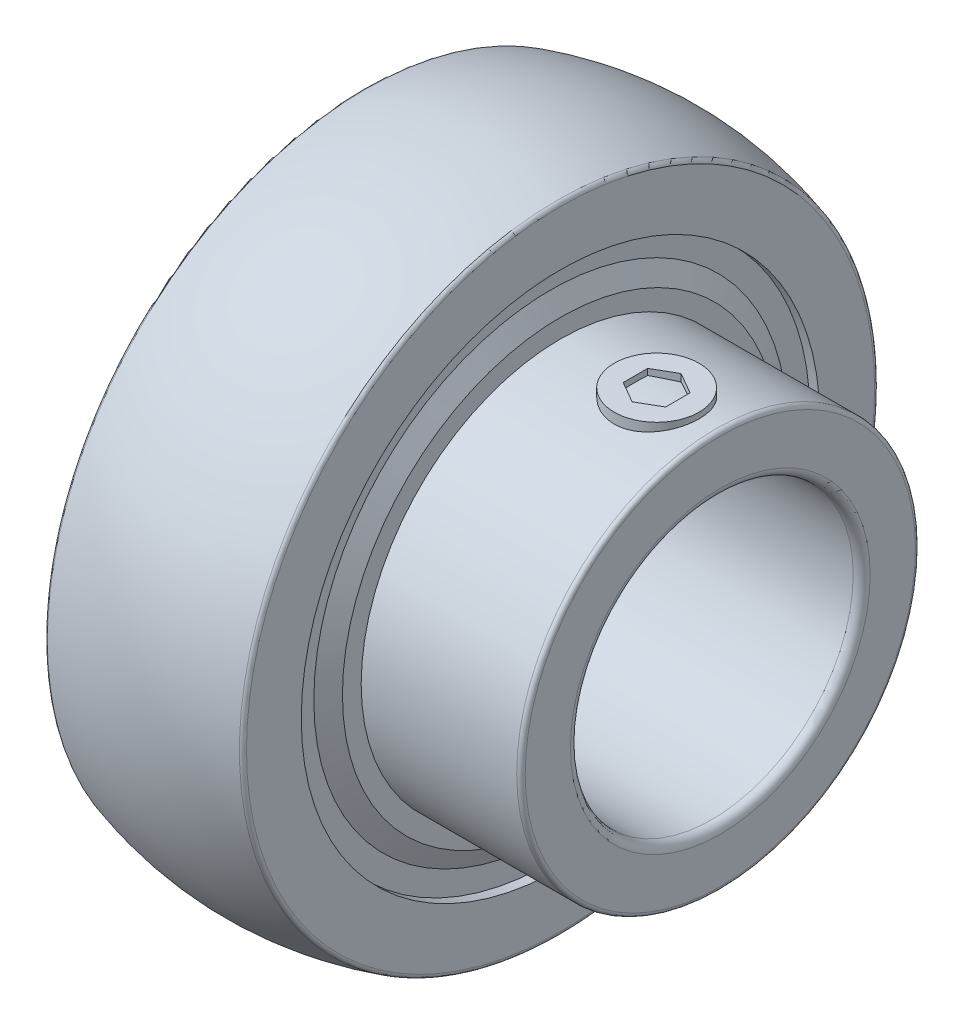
ISO-10303-21;
HEADER;
FILE_DESCRIPTION(('STEP AP214'),'2;1');
FILE_NAME('part.step','',(''),(''),'','','');
FILE_SCHEMA(('AUTOMOTIVE_DESIGN { 1 0 10303 214 1 1 1 1 }'));
ENDSEC;
DATA;
#1=APPLICATION_CONTEXT('core data for automotive mechanical design processes');
#2=APPLICATION_PROTOCOL_DEFINITION('international standard','automotive_design',2000,#1);
#3=PRODUCT_CONTEXT('',#1,'mechanical');
#4=PRODUCT('Part','Part','',(#3));
#5=PRODUCT_RELATED_PRODUCT_CATEGORY('part','',(#4));
#6=PRODUCT_DEFINITION_FORMATION('','',#4);
#7=PRODUCT_DEFINITION_CONTEXT('part definition',#1,'design');
#8=PRODUCT_DEFINITION('design','',#6,#7);
#9=PRODUCT_DEFINITION_SHAPE('','',#8);
#10=(LENGTH_UNIT() NAMED_UNIT(*) SI_UNIT(.MILLI.,.METRE.));
#11=(NAMED_UNIT(*) PLANE_ANGLE_UNIT() SI_UNIT($,.RADIAN.));
#12=(NAMED_UNIT(*) SI_UNIT($,.STERADIAN.) SOLID_ANGLE_UNIT());
#13=UNCERTAINTY_MEASURE_WITH_UNIT(LENGTH_MEASURE(1.E-05),#10,'distance_accuracy_value','');
#14=(GEOMETRIC_REPRESENTATION_CONTEXT(3) GLOBAL_UNCERTAINTY_ASSIGNED_CONTEXT((#13)) GLOBAL_UNIT_ASSIGNED_CONTEXT((#10,
#11,#12)) REPRESENTATION_CONTEXT('',''));
#15=CARTESIAN_POINT('',(0.,0.,0.));
#16=DIRECTION('',(0.,0.,1.));
#17=DIRECTION('',(1.,0.,0.));
#18=AXIS2_PLACEMENT_3D('',#15,#16,#17);
#19=CARTESIAN_POINT('',(15.3,10.,-0.866025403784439));
#20=DIRECTION('',(-0.5,0.,0.866025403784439));
#21=DIRECTION('',(0.866025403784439,0.,0.5));
#22=AXIS2_PLACEMENT_3D('',#19,#20,#21);
#23=PLANE('',#22);
#24=DIRECTION('',(0.866025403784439,0.,0.5));
#25=VECTOR('',#24,1.);
#26=CARTESIAN_POINT('',(15.3,14.51,-0.866025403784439));
#27=LINE('',#26,#25);
#28=CARTESIAN_POINT('',(15.3,14.51,-0.866025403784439));
#29=VERTEX_POINT('',#28);
#30=CARTESIAN_POINT('',(13.8,14.51,-1.73205080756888));
#31=VERTEX_POINT('',#30);
#32=EDGE_CURVE('E189',#29,#31,#27,.F.);
#33=ORIENTED_EDGE('',*,*,#32,.T.);
#34=DIRECTION('',(0.,1.,0.));
#35=VECTOR('',#34,1.);
#36=CARTESIAN_POINT('',(13.8,10.,-1.73205080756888));
#37=LINE('',#36,#35);
#38=CARTESIAN_POINT('',(13.8,13.9932126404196,-1.73205080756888));
#39=VERTEX_POINT('',#38);
#40=EDGE_CURVE('E162',#39,#31,#37,.T.);
#41=ORIENTED_EDGE('',*,*,#40,.F.);
#42=CARTESIAN_POINT('',(16.8,0.,0.));
#43=DIRECTION('',(-0.5,0.,0.866025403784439));
#44=DIRECTION('',(0.866025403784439,0.,0.5));
#45=AXIS2_PLACEMENT_3D('',#42,#43,#44);
#46=ELLIPSE('',#45,28.2,14.1);
#47=CARTESIAN_POINT('',(15.3,14.0733791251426,-0.866025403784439));
#48=VERTEX_POINT('',#47);
#49=EDGE_CURVE('E173',#48,#39,#46,.T.);
#50=ORIENTED_EDGE('',*,*,#49,.F.);
#51=DIRECTION('',(0.,1.,0.));
#52=VECTOR('',#51,1.);
#53=CARTESIAN_POINT('',(15.3,10.,-0.866025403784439));
#54=LINE('',#53,#52);
#55=EDGE_CURVE('E184',#48,#29,#54,.T.);
#56=ORIENTED_EDGE('',*,*,#55,.T.);
#57=EDGE_LOOP('',(#33,#41,#50,#56));
#58=FACE_BOUND('',#57,.T.);
#59=ADVANCED_FACE('F18',(#58),#23,.T.);
#60=CARTESIAN_POINT('',(13.8,10.,-1.73205080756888));
#61=DIRECTION('',(0.5,0.,0.866025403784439));
#62=DIRECTION('',(0.866025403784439,0.,-0.5));
#63=AXIS2_PLACEMENT_3D('',#60,#61,#62);
#64=PLANE('',#63);
#65=DIRECTION('',(0.866025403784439,0.,-0.5));
#66=VECTOR('',#65,1.);
#67=CARTESIAN_POINT('',(13.8,14.51,-1.73205080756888));
#68=LINE('',#67,#66);
#69=CARTESIAN_POINT('',(12.3,14.51,-0.86602540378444));
#70=VERTEX_POINT('',#69);
#71=EDGE_CURVE('E572',#31,#70,#68,.F.);
#72=ORIENTED_EDGE('',*,*,#71,.T.);
#73=DIRECTION('',(0.,1.,0.));
#74=VECTOR('',#73,1.);
#75=CARTESIAN_POINT('',(12.3,10.,-0.86602540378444));
#76=LINE('',#75,#74);
#77=CARTESIAN_POINT('',(12.3,14.0733791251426,-0.86602540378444));
#78=VERTEX_POINT('',#77);
#79=EDGE_CURVE('E563',#70,#78,#76,.F.);
#80=ORIENTED_EDGE('',*,*,#79,.T.);
#81=CARTESIAN_POINT('',(10.8,0.,0.));
#82=DIRECTION('',(0.5,0.,0.866025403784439));
#83=DIRECTION('',(0.866025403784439,0.,-0.5));
#84=AXIS2_PLACEMENT_3D('',#81,#82,#83);
#85=ELLIPSE('',#84,28.2,14.1);
#86=EDGE_CURVE('E193',#39,#78,#85,.T.);
#87=ORIENTED_EDGE('',*,*,#86,.F.);
#88=ORIENTED_EDGE('',*,*,#40,.T.);
#89=EDGE_LOOP('',(#72,#80,#87,#88));
#90=FACE_BOUND('',#89,.T.);
#91=ADVANCED_FACE('F892',(#90),#64,.T.);
#92=CARTESIAN_POINT('',(13.8,-3.5,-9.52627944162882));
#93=DIRECTION('',(-0.5,-0.75,0.433012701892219));
#94=DIRECTION('',(0.832050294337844,-0.554700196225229,0.));
#95=AXIS2_PLACEMENT_3D('',#92,#93,#94);
#96=PLANE('',#95);
#97=DIRECTION('',(0.866025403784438,-0.433012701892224,0.249999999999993));
#98=VECTOR('',#97,1.);
#99=CARTESIAN_POINT('',(13.8,-5.75499999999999,-13.4320540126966));
#100=LINE('',#99,#98);
#101=CARTESIAN_POINT('',(13.8,-5.755,-13.4320540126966));
#102=VERTEX_POINT('',#101);
#103=CARTESIAN_POINT('',(15.3,-6.505,-12.9990413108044));
#104=VERTEX_POINT('',#103);
#105=EDGE_CURVE('E558',#102,#104,#100,.T.);
#106=ORIENTED_EDGE('',*,*,#105,.T.);
#107=DIRECTION('',(0.,0.499999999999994,0.866025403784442));
#108=VECTOR('',#107,1.);
#109=CARTESIAN_POINT('',(15.3,-6.50499999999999,-12.9990413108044));
#110=LINE('',#109,#108);
#111=CARTESIAN_POINT('',(15.2999999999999,-6.28668956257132,-12.6209165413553));
#112=VERTEX_POINT('',#111);
#113=EDGE_CURVE('E555',#104,#112,#110,.T.);
#114=ORIENTED_EDGE('',*,*,#113,.T.);
#115=CARTESIAN_POINT('',(16.8,0.,0.));
#116=DIRECTION('',(-0.5,-0.75,0.433012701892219));
#117=DIRECTION('',(0.866025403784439,-0.43301270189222,0.25));
#118=AXIS2_PLACEMENT_3D('',#115,#116,#117);
#119=ELLIPSE('',#118,28.2,14.1);
#120=CARTESIAN_POINT('',(13.8,-5.49660632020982,-12.9845030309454));
#121=VERTEX_POINT('',#120);
#122=EDGE_CURVE('E541',#121,#112,#119,.T.);
#123=ORIENTED_EDGE('',*,*,#122,.F.);
#124=DIRECTION('',(0.,-0.500000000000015,-0.86602540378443));
#125=VECTOR('',#124,1.);
#126=CARTESIAN_POINT('',(13.8,-5.49660632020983,-12.9845030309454));
#127=LINE('',#126,#125);
#128=EDGE_CURVE('E559',#121,#102,#127,.T.);
#129=ORIENTED_EDGE('',*,*,#128,.T.);
#130=EDGE_LOOP('',(#106,#114,#123,#129));
#131=FACE_BOUND('',#130,.T.);
#132=ADVANCED_FACE('F766',(#131),#96,.T.);
#133=CARTESIAN_POINT('',(15.3,-5.75,-8.22724133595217));
#134=DIRECTION('',(-0.5,0.75,-0.433012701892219));
#135=DIRECTION('',(-0.832050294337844,-0.554700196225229,0.));
#136=AXIS2_PLACEMENT_3D('',#133,#134,#135);
#137=PLANE('',#136);
#138=DIRECTION('',(-0.866025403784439,-0.433012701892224,0.249999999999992));
#139=VECTOR('',#138,1.);
#140=CARTESIAN_POINT('',(15.3,-8.005,-12.13301590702));
#141=LINE('',#140,#139);
#142=CARTESIAN_POINT('',(15.3,-8.005,-12.13301590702));
#143=VERTEX_POINT('',#142);
#144=CARTESIAN_POINT('',(13.8,-8.75500000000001,-11.7000032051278));
#145=VERTEX_POINT('',#144);
#146=EDGE_CURVE('E550',#143,#145,#141,.T.);
#147=ORIENTED_EDGE('',*,*,#146,.T.);
#148=DIRECTION('',(0.,-0.499999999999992,-0.866025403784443));
#149=VECTOR('',#148,1.);
#150=CARTESIAN_POINT('',(13.8,-8.49660632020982,-11.2524522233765));
#151=LINE('',#150,#149);
#152=CARTESIAN_POINT('',(13.8,-8.49660632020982,-11.2524522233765));
#153=VERTEX_POINT('',#152);
#154=EDGE_CURVE('E546',#153,#145,#151,.T.);
#155=ORIENTED_EDGE('',*,*,#154,.F.);
#156=CARTESIAN_POINT('',(16.8,0.,0.));
#157=DIRECTION('',(-0.5,0.75,-0.433012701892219));
#158=DIRECTION('',(0.866025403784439,0.43301270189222,-0.25));
#159=AXIS2_PLACEMENT_3D('',#156,#157,#158);
#160=ELLIPSE('',#159,28.2,14.1);
#161=CARTESIAN_POINT('',(15.3000000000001,-7.78668956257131,-11.7548911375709));
#162=VERTEX_POINT('',#161);
#163=EDGE_CURVE('E741',#162,#153,#160,.T.);
#164=ORIENTED_EDGE('',*,*,#163,.F.);
#165=DIRECTION('',(0.,-0.499999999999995,-0.866025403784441));
#166=VECTOR('',#165,1.);
#167=CARTESIAN_POINT('',(15.3,-7.78668956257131,-11.7548911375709));
#168=LINE('',#167,#166);
#169=EDGE_CURVE('E551',#162,#143,#168,.T.);
#170=ORIENTED_EDGE('',*,*,#169,.T.);
#171=EDGE_LOOP('',(#147,#155,#164,#170));
#172=FACE_BOUND('',#171,.T.);
#173=ADVANCED_FACE('F757',(#172),#137,.T.);
#174=CARTESIAN_POINT('',(13.8,-6.5,-7.79422863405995));
#175=DIRECTION('',(0.5,0.75,-0.433012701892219));
#176=DIRECTION('',(-0.832050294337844,0.554700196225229,0.));
#177=AXIS2_PLACEMENT_3D('',#174,#175,#176);
#178=PLANE('',#177);
#179=DIRECTION('',(-0.866025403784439,0.433012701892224,-0.249999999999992));
#180=VECTOR('',#179,1.);
#181=CARTESIAN_POINT('',(13.8,-8.75500000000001,-11.7000032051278));
#182=LINE('',#181,#180);
#183=CARTESIAN_POINT('',(12.3,-8.005,-12.13301590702));
#184=VERTEX_POINT('',#183);
#185=EDGE_CURVE('E201',#145,#184,#182,.T.);
#186=ORIENTED_EDGE('',*,*,#185,.T.);
#187=DIRECTION('',(0.,0.499999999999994,0.866025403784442));
#188=VECTOR('',#187,1.);
#189=CARTESIAN_POINT('',(12.3,-8.005,-12.13301590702));
#190=LINE('',#189,#188);
#191=CARTESIAN_POINT('',(12.2999999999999,-7.78668956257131,-11.7548911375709));
#192=VERTEX_POINT('',#191);
#193=EDGE_CURVE('E194',#184,#192,#190,.T.);
#194=ORIENTED_EDGE('',*,*,#193,.T.);
#195=CARTESIAN_POINT('',(10.8,0.,0.));
#196=DIRECTION('',(0.5,0.75,-0.433012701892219));
#197=DIRECTION('',(0.866025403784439,-0.43301270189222,0.25));
#198=AXIS2_PLACEMENT_3D('',#195,#196,#197);
#199=ELLIPSE('',#198,28.2,14.1);
#200=EDGE_CURVE('E737',#153,#192,#199,.T.);
#201=ORIENTED_EDGE('',*,*,#200,.F.);
#202=ORIENTED_EDGE('',*,*,#154,.T.);
#203=EDGE_LOOP('',(#186,#194,#201,#202));
#204=FACE_BOUND('',#203,.T.);
#205=ADVANCED_FACE('F770',(#204),#178,.T.);
#206=CARTESIAN_POINT('',(13.8,10.,1.73205080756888));
#207=DIRECTION('',(-0.5,0.,-0.866025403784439));
#208=DIRECTION('',(-0.866025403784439,0.,0.5));
#209=AXIS2_PLACEMENT_3D('',#206,#207,#208);
#210=PLANE('',#209);
#211=DIRECTION('',(-0.866025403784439,0.,0.5));
#212=VECTOR('',#211,1.);
#213=CARTESIAN_POINT('',(13.8,14.51,1.73205080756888));
#214=LINE('',#213,#212);
#215=CARTESIAN_POINT('',(13.8,14.51,1.73205080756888));
#216=VERTEX_POINT('',#215);
#217=CARTESIAN_POINT('',(15.3,14.51,0.866025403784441));
#218=VERTEX_POINT('',#217);
#219=EDGE_CURVE('E542',#216,#218,#214,.F.);
#220=ORIENTED_EDGE('',*,*,#219,.T.);
#221=DIRECTION('',(0.,1.,0.));
#222=VECTOR('',#221,1.);
#223=CARTESIAN_POINT('',(15.3,10.,0.866025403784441));
#224=LINE('',#223,#222);
#225=CARTESIAN_POINT('',(15.3,14.0733791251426,0.866025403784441));
#226=VERTEX_POINT('',#225);
#227=EDGE_CURVE('E538',#218,#226,#224,.F.);
#228=ORIENTED_EDGE('',*,*,#227,.T.);
#229=CARTESIAN_POINT('',(16.8,0.,0.));
#230=DIRECTION('',(-0.5,0.,-0.866025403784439));
#231=DIRECTION('',(0.866025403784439,0.,-0.5));
#232=AXIS2_PLACEMENT_3D('',#229,#230,#231);
#233=ELLIPSE('',#232,28.2,14.1);
#234=CARTESIAN_POINT('',(13.8,13.9932126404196,1.73205080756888));
#235=VERTEX_POINT('',#234);
#236=EDGE_CURVE('E176',#235,#226,#233,.T.);
#237=ORIENTED_EDGE('',*,*,#236,.F.);
#238=DIRECTION('',(0.,1.,0.));
#239=VECTOR('',#238,1.);
#240=CARTESIAN_POINT('',(13.8,10.,1.73205080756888));
#241=LINE('',#240,#239);
#242=EDGE_CURVE('E199',#235,#216,#241,.T.);
#243=ORIENTED_EDGE('',*,*,#242,.T.);
#244=EDGE_LOOP('',(#220,#228,#237,#243));
#245=FACE_BOUND('',#244,.T.);
#246=ADVANCED_FACE('F772',(#245),#210,.T.);
#247=CARTESIAN_POINT('',(12.5,0.,0.));
#248=DIRECTION('',(1.,0.,0.));
#249=DIRECTION('',(0.,0.,-1.));
#250=AXIS2_PLACEMENT_3D('',#247,#248,#249);
#251=CYLINDRICAL_SURFACE('',#250,14.1);
#252=ORIENTED_EDGE('',*,*,#163,.T.);
#253=ORIENTED_EDGE('',*,*,#200,.T.);
#254=CARTESIAN_POINT('',(12.3,0.,0.));
#255=DIRECTION('',(1.,0.,0.));
#256=DIRECTION('',(0.,0.,-1.));
#257=AXIS2_PLACEMENT_3D('',#254,#255,#256);
#258=CIRCLE('',#257,14.1);
#259=CARTESIAN_POINT('',(12.3000000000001,-6.28668956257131,-12.6209165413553));
#260=VERTEX_POINT('',#259);
#261=EDGE_CURVE('E731',#260,#192,#258,.F.);
#262=ORIENTED_EDGE('',*,*,#261,.F.);
#263=CARTESIAN_POINT('',(10.8,0.,0.));
#264=DIRECTION('',(0.5,-0.75,0.433012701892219));
#265=DIRECTION('',(0.866025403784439,0.43301270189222,-0.25));
#266=AXIS2_PLACEMENT_3D('',#263,#264,#265);
#267=ELLIPSE('',#266,28.2,14.1);
#268=EDGE_CURVE('E513',#121,#260,#267,.F.);
#269=ORIENTED_EDGE('',*,*,#268,.F.);
#270=ORIENTED_EDGE('',*,*,#122,.T.);
#271=CARTESIAN_POINT('',(15.3,0.,0.));
#272=DIRECTION('',(1.,0.,0.));
#273=DIRECTION('',(0.,0.,-1.));
#274=AXIS2_PLACEMENT_3D('',#271,#272,#273);
#275=CIRCLE('',#274,14.1);
#276=EDGE_CURVE('E727',#162,#112,#275,.T.);
#277=ORIENTED_EDGE('',*,*,#276,.F.);
#278=EDGE_LOOP('',(#252,#253,#262,#269,#270,#277));
#279=FACE_BOUND('',#278,.T.);
#280=ADVANCED_FACE('F750',(#279),#251,.T.);
#281=CARTESIAN_POINT('',(12.5,0.,0.));
#282=DIRECTION('',(1.,0.,0.));
#283=DIRECTION('',(0.,0.,-1.));
#284=AXIS2_PLACEMENT_3D('',#281,#282,#283);
#285=CYLINDRICAL_SURFACE('',#284,14.1);
#286=ORIENTED_EDGE('',*,*,#236,.T.);
#287=CARTESIAN_POINT('',(15.3,0.,0.));
#288=DIRECTION('',(1.,0.,0.));
#289=DIRECTION('',(0.,0.,-1.));
#290=AXIS2_PLACEMENT_3D('',#287,#288,#289);
#291=CIRCLE('',#290,14.1);
#292=EDGE_CURVE('E169',#48,#226,#291,.T.);
#293=ORIENTED_EDGE('',*,*,#292,.F.);
#294=ORIENTED_EDGE('',*,*,#49,.T.);
#295=ORIENTED_EDGE('',*,*,#86,.T.);
#296=CARTESIAN_POINT('',(12.3,0.,0.));
#297=DIRECTION('',(1.,0.,0.));
#298=DIRECTION('',(0.,0.,-1.));
#299=AXIS2_PLACEMENT_3D('',#296,#297,#298);
#300=CIRCLE('',#299,14.1);
#301=CARTESIAN_POINT('',(12.3,14.0733791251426,0.866025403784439));
#302=VERTEX_POINT('',#301);
#303=EDGE_CURVE('E180',#302,#78,#300,.F.);
#304=ORIENTED_EDGE('',*,*,#303,.F.);
#305=CARTESIAN_POINT('',(10.8,0.,0.));
#306=DIRECTION('',(0.5,0.,-0.866025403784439));
#307=DIRECTION('',(0.866025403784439,0.,0.5));
#308=AXIS2_PLACEMENT_3D('',#305,#306,#307);
#309=ELLIPSE('',#308,28.2,14.1);
#310=EDGE_CURVE('E179',#235,#302,#309,.F.);
#311=ORIENTED_EDGE('',*,*,#310,.F.);
#312=EDGE_LOOP('',(#286,#293,#294,#295,#304,#311));
#313=FACE_BOUND('',#312,.T.);
#314=ADVANCED_FACE('F171',(#313),#285,.T.);
#315=CARTESIAN_POINT('',(2.8,0.,0.));
#316=DIRECTION('',(1.,0.,0.));
#317=DIRECTION('',(0.,0.,-1.));
#318=AXIS2_PLACEMENT_3D('',#315,#316,#317);
#319=CYLINDRICAL_SURFACE('',#318,10.);
#320=CARTESIAN_POINT('',(-12.1,0.,0.));
#321=DIRECTION('',(-1.,0.,0.));
#322=DIRECTION('',(0.,0.,1.));
#323=AXIS2_PLACEMENT_3D('',#320,#321,#322);
#324=CIRCLE('',#323,10.);
#325=CARTESIAN_POINT('',(-12.1,0.,10.));
#326=VERTEX_POINT('',#325);
#327=EDGE_CURVE('E514',#326,#326,#324,.F.);
#328=ORIENTED_EDGE('',*,*,#327,.F.);
#329=EDGE_LOOP('',(#328));
#330=FACE_BOUND('',#329,.T.);
#331=CARTESIAN_POINT('',(17.7,0.,0.));
#332=DIRECTION('',(-1.,0.,0.));
#333=DIRECTION('',(0.,0.,1.));
#334=AXIS2_PLACEMENT_3D('',#331,#332,#333);
#335=CIRCLE('',#334,10.);
#336=CARTESIAN_POINT('',(17.7,0.,10.));
#337=VERTEX_POINT('',#336);
#338=EDGE_CURVE('E508',#337,#337,#335,.T.);
#339=ORIENTED_EDGE('',*,*,#338,.F.);
#340=EDGE_LOOP('',(#339));
#341=FACE_BOUND('',#340,.T.);
#342=ADVANCED_FACE('F965',(#330,#341),#319,.F.);
#343=CARTESIAN_POINT('',(12.3,-5.75,-8.22724133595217));
#344=DIRECTION('',(1.,0.,0.));
#345=DIRECTION('',(0.,0.,-1.));
#346=AXIS2_PLACEMENT_3D('',#343,#344,#345);
#347=PLANE('',#346);
#348=DIRECTION('',(0.,0.866025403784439,-0.5));
#349=VECTOR('',#348,1.);
#350=CARTESIAN_POINT('',(12.3,-7.255,-12.5660286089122));
#351=LINE('',#350,#349);
#352=CARTESIAN_POINT('',(12.3,-6.50499999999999,-12.9990413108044));
#353=VERTEX_POINT('',#352);
#354=EDGE_CURVE('E518',#353,#184,#351,.F.);
#355=ORIENTED_EDGE('',*,*,#354,.F.);
#356=DIRECTION('',(0.,-0.499999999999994,-0.866025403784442));
#357=VECTOR('',#356,1.);
#358=CARTESIAN_POINT('',(12.3,-6.28668956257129,-12.6209165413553));
#359=LINE('',#358,#357);
#360=EDGE_CURVE('E509',#260,#353,#359,.T.);
#361=ORIENTED_EDGE('',*,*,#360,.F.);
#362=ORIENTED_EDGE('',*,*,#261,.T.);
#363=ORIENTED_EDGE('',*,*,#193,.F.);
#364=EDGE_LOOP('',(#355,#361,#362,#363));
#365=FACE_BOUND('',#364,.T.);
#366=ADVANCED_FACE('F762',(#365),#347,.T.);
#367=CARTESIAN_POINT('',(15.3,-4.25,-9.09326673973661));
#368=DIRECTION('',(-1.,0.,0.));
#369=DIRECTION('',(0.,0.,1.));
#370=AXIS2_PLACEMENT_3D('',#367,#368,#369);
#371=PLANE('',#370);
#372=DIRECTION('',(0.,0.866025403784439,-0.5));
#373=VECTOR('',#372,1.);
#374=CARTESIAN_POINT('',(15.3,-7.255,-12.5660286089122));
#375=LINE('',#374,#373);
#376=EDGE_CURVE('E534',#143,#104,#375,.T.);
#377=ORIENTED_EDGE('',*,*,#376,.F.);
#378=ORIENTED_EDGE('',*,*,#169,.F.);
#379=ORIENTED_EDGE('',*,*,#276,.T.);
#380=ORIENTED_EDGE('',*,*,#113,.F.);
#381=EDGE_LOOP('',(#377,#378,#379,#380));
#382=FACE_BOUND('',#381,.T.);
#383=ADVANCED_FACE('F754',(#382),#371,.T.);
#384=CARTESIAN_POINT('',(12.3,-4.25,-9.09326673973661));
#385=DIRECTION('',(0.5,-0.75,0.433012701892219));
#386=DIRECTION('',(0.832050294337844,0.554700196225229,0.));
#387=AXIS2_PLACEMENT_3D('',#384,#385,#386);
#388=PLANE('',#387);
#389=DIRECTION('',(-0.866025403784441,-0.433012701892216,0.249999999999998));
#390=VECTOR('',#389,1.);
#391=CARTESIAN_POINT('',(13.8,-5.75500000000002,-13.4320540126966));
#392=LINE('',#391,#390);
#393=EDGE_CURVE('E526',#102,#353,#392,.T.);
#394=ORIENTED_EDGE('',*,*,#393,.F.);
#395=ORIENTED_EDGE('',*,*,#128,.F.);
#396=ORIENTED_EDGE('',*,*,#268,.T.);
#397=ORIENTED_EDGE('',*,*,#360,.T.);
#398=EDGE_LOOP('',(#394,#395,#396,#397));
#399=FACE_BOUND('',#398,.T.);
#400=ADVANCED_FACE('F765',(#399),#388,.T.);
#401=CARTESIAN_POINT('',(12.3,10.,-0.866025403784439));
#402=DIRECTION('',(1.,0.,0.));
#403=DIRECTION('',(0.,0.,-1.));
#404=AXIS2_PLACEMENT_3D('',#401,#402,#403);
#405=PLANE('',#404);
#406=DIRECTION('',(0.,0.,1.));
#407=VECTOR('',#406,1.);
#408=CARTESIAN_POINT('',(12.3,14.51,0.));
#409=LINE('',#408,#407);
#410=CARTESIAN_POINT('',(12.3,14.51,0.866025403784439));
#411=VERTEX_POINT('',#410);
#412=EDGE_CURVE('E522',#411,#70,#409,.F.);
#413=ORIENTED_EDGE('',*,*,#412,.F.);
#414=DIRECTION('',(0.,1.,0.));
#415=VECTOR('',#414,1.);
#416=CARTESIAN_POINT('',(12.3,10.,0.866025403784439));
#417=LINE('',#416,#415);
#418=EDGE_CURVE('E499',#302,#411,#417,.T.);
#419=ORIENTED_EDGE('',*,*,#418,.F.);
#420=ORIENTED_EDGE('',*,*,#303,.T.);
#421=ORIENTED_EDGE('',*,*,#79,.F.);
#422=EDGE_LOOP('',(#413,#419,#420,#421));
#423=FACE_BOUND('',#422,.T.);
#424=ADVANCED_FACE('F889',(#423),#405,.T.);
#425=CARTESIAN_POINT('',(15.3,10.,0.866025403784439));
#426=DIRECTION('',(-1.,0.,0.));
#427=DIRECTION('',(0.,0.,1.));
#428=AXIS2_PLACEMENT_3D('',#425,#426,#427);
#429=PLANE('',#428);
#430=DIRECTION('',(0.,0.,1.));
#431=VECTOR('',#430,1.);
#432=CARTESIAN_POINT('',(15.3,14.51,0.));
#433=LINE('',#432,#431);
#434=EDGE_CURVE('E187',#29,#218,#433,.T.);
#435=ORIENTED_EDGE('',*,*,#434,.F.);
#436=ORIENTED_EDGE('',*,*,#55,.F.);
#437=ORIENTED_EDGE('',*,*,#292,.T.);
#438=ORIENTED_EDGE('',*,*,#227,.F.);
#439=EDGE_LOOP('',(#435,#436,#437,#438));
#440=FACE_BOUND('',#439,.T.);
#441=ADVANCED_FACE('F185',(#440),#429,.T.);
#442=CARTESIAN_POINT('',(12.3,10.,0.866025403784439));
#443=DIRECTION('',(0.5,0.,-0.866025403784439));
#444=DIRECTION('',(-0.866025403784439,0.,-0.5));
#445=AXIS2_PLACEMENT_3D('',#442,#443,#444);
#446=PLANE('',#445);
#447=DIRECTION('',(-0.866025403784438,0.,-0.500000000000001));
#448=VECTOR('',#447,1.);
#449=CARTESIAN_POINT('',(13.8,14.51,1.73205080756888));
#450=LINE('',#449,#448);
#451=EDGE_CURVE('E527',#216,#411,#450,.T.);
#452=ORIENTED_EDGE('',*,*,#451,.F.);
#453=ORIENTED_EDGE('',*,*,#242,.F.);
#454=ORIENTED_EDGE('',*,*,#310,.T.);
#455=ORIENTED_EDGE('',*,*,#418,.T.);
#456=EDGE_LOOP('',(#452,#453,#454,#455));
#457=FACE_BOUND('',#456,.T.);
#458=ADVANCED_FACE('F886',(#457),#446,.T.);
#459=CARTESIAN_POINT('',(17.7,0.,0.));
#460=DIRECTION('',(-1.,0.,0.));
#461=DIRECTION('',(0.,0.,1.));
#462=AXIS2_PLACEMENT_3D('',#459,#460,#461);
#463=TOROIDAL_SURFACE('',#462,10.6,0.600000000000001);
#464=ORIENTED_EDGE('',*,*,#338,.T.);
#465=EDGE_LOOP('',(#464));
#466=FACE_BOUND('',#465,.T.);
#467=CARTESIAN_POINT('',(18.3,0.,0.));
#468=DIRECTION('',(1.,0.,0.));
#469=DIRECTION('',(0.,0.,-1.));
#470=AXIS2_PLACEMENT_3D('',#467,#468,#469);
#471=CIRCLE('',#470,10.6);
#472=CARTESIAN_POINT('',(18.3,10.6,0.));
#473=VERTEX_POINT('',#472);
#474=CARTESIAN_POINT('',(18.3,0.,-10.6));
#475=VERTEX_POINT('',#474);
#476=EDGE_CURVE('E495',#473,#475,#471,.F.);
#477=ORIENTED_EDGE('',*,*,#476,.F.);
#478=CARTESIAN_POINT('',(18.3,0.,0.));
#479=DIRECTION('',(1.,0.,0.));
#480=DIRECTION('',(0.,1.,0.));
#481=AXIS2_PLACEMENT_3D('',#478,#479,#480);
#482=CIRCLE('',#481,10.6);
#483=CARTESIAN_POINT('',(18.3,0.,10.6));
#484=VERTEX_POINT('',#483);
#485=EDGE_CURVE('E483',#484,#473,#482,.F.);
#486=ORIENTED_EDGE('',*,*,#485,.F.);
#487=CARTESIAN_POINT('',(18.3,0.,0.));
#488=DIRECTION('',(1.,0.,0.));
#489=DIRECTION('',(0.,0.,1.));
#490=AXIS2_PLACEMENT_3D('',#487,#488,#489);
#491=CIRCLE('',#490,10.6);
#492=EDGE_CURVE('E808',#475,#484,#491,.F.);
#493=ORIENTED_EDGE('',*,*,#492,.F.);
#494=EDGE_LOOP('',(#477,#486,#493));
#495=FACE_BOUND('',#494,.T.);
#496=ADVANCED_FACE('F454',(#466,#495),#463,.T.);
#497=CARTESIAN_POINT('',(-12.1,0.,0.));
#498=DIRECTION('',(-1.,0.,0.));
#499=DIRECTION('',(0.,0.,1.));
#500=AXIS2_PLACEMENT_3D('',#497,#498,#499);
#501=TOROIDAL_SURFACE('',#500,10.6,0.6);
#502=ORIENTED_EDGE('',*,*,#327,.T.);
#503=EDGE_LOOP('',(#502));
#504=FACE_BOUND('',#503,.T.);
#505=CARTESIAN_POINT('',(-12.7,0.,0.));
#506=DIRECTION('',(-1.,0.,0.));
#507=DIRECTION('',(0.,0.,-1.));
#508=AXIS2_PLACEMENT_3D('',#505,#506,#507);
#509=CIRCLE('',#508,10.6);
#510=CARTESIAN_POINT('',(-12.7,0.,10.6));
#511=VERTEX_POINT('',#510);
#512=CARTESIAN_POINT('',(-12.7,0.,-10.6));
#513=VERTEX_POINT('',#512);
#514=EDGE_CURVE('E470',#511,#513,#509,.F.);
#515=ORIENTED_EDGE('',*,*,#514,.F.);
#516=CARTESIAN_POINT('',(-12.7,0.,0.));
#517=DIRECTION('',(-1.,0.,0.));
#518=DIRECTION('',(0.,0.,1.));
#519=AXIS2_PLACEMENT_3D('',#516,#517,#518);
#520=CIRCLE('',#519,10.6);
#521=CARTESIAN_POINT('',(-12.7,10.6,0.));
#522=VERTEX_POINT('',#521);
#523=EDGE_CURVE('E436',#522,#511,#520,.F.);
#524=ORIENTED_EDGE('',*,*,#523,.F.);
#525=CARTESIAN_POINT('',(-12.7,0.,0.));
#526=DIRECTION('',(-1.,0.,0.));
#527=DIRECTION('',(0.,1.,0.));
#528=AXIS2_PLACEMENT_3D('',#525,#526,#527);
#529=CIRCLE('',#528,10.6);
#530=EDGE_CURVE('E804',#513,#522,#529,.F.);
#531=ORIENTED_EDGE('',*,*,#530,.F.);
#532=EDGE_LOOP('',(#515,#524,#531));
#533=FACE_BOUND('',#532,.T.);
#534=ADVANCED_FACE('F443',(#504,#533),#501,.T.);
#535=CARTESIAN_POINT('',(0.,-7.255,-12.5660286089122));
#536=DIRECTION('',(0.,-0.5,-0.866025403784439));
#537=DIRECTION('',(0.,0.866025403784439,-0.5));
#538=AXIS2_PLACEMENT_3D('',#535,#536,#537);
#539=PLANE('',#538);
#540=ORIENTED_EDGE('',*,*,#105,.F.);
#541=ORIENTED_EDGE('',*,*,#393,.T.);
#542=ORIENTED_EDGE('',*,*,#354,.T.);
#543=ORIENTED_EDGE('',*,*,#185,.F.);
#544=ORIENTED_EDGE('',*,*,#146,.F.);
#545=ORIENTED_EDGE('',*,*,#376,.T.);
#546=EDGE_LOOP('',(#540,#541,#542,#543,#544,#545));
#547=FACE_BOUND('',#546,.T.);
#548=CARTESIAN_POINT('',(13.8,-7.255,-12.5660286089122));
#549=DIRECTION('',(0.,0.5,0.866025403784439));
#550=DIRECTION('',(0.,-0.866025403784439,0.5));
#551=AXIS2_PLACEMENT_3D('',#548,#549,#550);
#552=CIRCLE('',#551,3.);
#553=CARTESIAN_POINT('',(13.8,-9.85307621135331,-11.0660286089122));
#554=VERTEX_POINT('',#553);
#555=EDGE_CURVE('E713',#554,#554,#552,.T.);
#556=ORIENTED_EDGE('',*,*,#555,.F.);
#557=EDGE_LOOP('',(#556));
#558=FACE_BOUND('',#557,.T.);
#559=ADVANCED_FACE('F453',(#547,#558),#539,.T.);
#560=CARTESIAN_POINT('',(0.,14.51,0.));
#561=DIRECTION('',(0.,1.,0.));
#562=DIRECTION('',(0.,0.,1.));
#563=AXIS2_PLACEMENT_3D('',#560,#561,#562);
#564=PLANE('',#563);
#565=ORIENTED_EDGE('',*,*,#219,.F.);
#566=ORIENTED_EDGE('',*,*,#451,.T.);
#567=ORIENTED_EDGE('',*,*,#412,.T.);
#568=ORIENTED_EDGE('',*,*,#71,.F.);
#569=ORIENTED_EDGE('',*,*,#32,.F.);
#570=ORIENTED_EDGE('',*,*,#434,.T.);
#571=EDGE_LOOP('',(#565,#566,#567,#568,#569,#570));
#572=FACE_BOUND('',#571,.T.);
#573=CARTESIAN_POINT('',(13.8,14.51,0.));
#574=DIRECTION('',(0.,-1.,0.));
#575=DIRECTION('',(0.,0.,-1.));
#576=AXIS2_PLACEMENT_3D('',#573,#574,#575);
#577=CIRCLE('',#576,3.);
#578=CARTESIAN_POINT('',(13.8,14.51,-3.));
#579=VERTEX_POINT('',#578);
#580=EDGE_CURVE('E710',#579,#579,#577,.T.);
#581=ORIENTED_EDGE('',*,*,#580,.F.);
#582=EDGE_LOOP('',(#581));
#583=FACE_BOUND('',#582,.T.);
#584=ADVANCED_FACE('F875',(#572,#583),#564,.T.);
#585=CARTESIAN_POINT('',(18.3,12.2,0.));
#586=DIRECTION('',(1.,0.,0.));
#587=DIRECTION('',(0.,0.,-1.));
#588=AXIS2_PLACEMENT_3D('',#585,#586,#587);
#589=PLANE('',#588);
#590=ORIENTED_EDGE('',*,*,#492,.T.);
#591=ORIENTED_EDGE('',*,*,#485,.T.);
#592=ORIENTED_EDGE('',*,*,#476,.T.);
#593=EDGE_LOOP('',(#590,#591,#592));
#594=FACE_BOUND('',#593,.T.);
#595=CARTESIAN_POINT('',(18.3,0.,0.));
#596=DIRECTION('',(-1.,0.,0.));
#597=DIRECTION('',(0.,0.,1.));
#598=AXIS2_PLACEMENT_3D('',#595,#596,#597);
#599=CIRCLE('',#598,13.8);
#600=CARTESIAN_POINT('',(18.3,0.,13.8));
#601=VERTEX_POINT('',#600);
#602=CARTESIAN_POINT('',(18.3,13.8,0.));
#603=VERTEX_POINT('',#602);
#604=EDGE_CURVE('E706',#601,#603,#599,.T.);
#605=ORIENTED_EDGE('',*,*,#604,.F.);
#606=CARTESIAN_POINT('',(18.3,0.,0.));
#607=DIRECTION('',(-1.,0.,0.));
#608=DIRECTION('',(0.,0.,-1.));
#609=AXIS2_PLACEMENT_3D('',#606,#607,#608);
#610=CIRCLE('',#609,13.8);
#611=CARTESIAN_POINT('',(18.3,0.,-13.8));
#612=VERTEX_POINT('',#611);
#613=EDGE_CURVE('E423',#612,#601,#610,.T.);
#614=ORIENTED_EDGE('',*,*,#613,.F.);
#615=CARTESIAN_POINT('',(18.3,0.,0.));
#616=DIRECTION('',(-1.,0.,0.));
#617=DIRECTION('',(0.,1.,0.));
#618=AXIS2_PLACEMENT_3D('',#615,#616,#617);
#619=CIRCLE('',#618,13.8);
#620=EDGE_CURVE('E704',#603,#612,#619,.T.);
#621=ORIENTED_EDGE('',*,*,#620,.F.);
#622=EDGE_LOOP('',(#605,#614,#621));
#623=FACE_BOUND('',#622,.T.);
#624=ADVANCED_FACE('F654',(#594,#623),#589,.T.);
#625=CARTESIAN_POINT('',(-12.7,12.2,0.));
#626=DIRECTION('',(-1.,0.,0.));
#627=DIRECTION('',(0.,0.,1.));
#628=AXIS2_PLACEMENT_3D('',#625,#626,#627);
#629=PLANE('',#628);
#630=CARTESIAN_POINT('',(-12.7,0.,0.));
#631=DIRECTION('',(1.,0.,0.));
#632=DIRECTION('',(0.,0.,1.));
#633=AXIS2_PLACEMENT_3D('',#630,#631,#632);
#634=CIRCLE('',#633,13.8);
#635=CARTESIAN_POINT('',(-12.7,0.,13.8));
#636=VERTEX_POINT('',#635);
#637=CARTESIAN_POINT('',(-12.7,0.,-13.8));
#638=VERTEX_POINT('',#637);
#639=EDGE_CURVE('E696',#636,#638,#634,.T.);
#640=ORIENTED_EDGE('',*,*,#639,.F.);
#641=CARTESIAN_POINT('',(-12.7,0.,0.));
#642=DIRECTION('',(1.,0.,0.));
#643=DIRECTION('',(0.,1.,0.));
#644=AXIS2_PLACEMENT_3D('',#641,#642,#643);
#645=CIRCLE('',#644,13.8);
#646=CARTESIAN_POINT('',(-12.7,13.8,0.));
#647=VERTEX_POINT('',#646);
#648=EDGE_CURVE('E409',#647,#636,#645,.T.);
#649=ORIENTED_EDGE('',*,*,#648,.F.);
#650=CARTESIAN_POINT('',(-12.7,0.,0.));
#651=DIRECTION('',(1.,0.,0.));
#652=DIRECTION('',(0.,0.,-1.));
#653=AXIS2_PLACEMENT_3D('',#650,#651,#652);
#654=CIRCLE('',#653,13.8);
#655=EDGE_CURVE('E698',#638,#647,#654,.T.);
#656=ORIENTED_EDGE('',*,*,#655,.F.);
#657=EDGE_LOOP('',(#640,#649,#656));
#658=FACE_BOUND('',#657,.T.);
#659=ORIENTED_EDGE('',*,*,#523,.T.);
#660=ORIENTED_EDGE('',*,*,#514,.T.);
#661=ORIENTED_EDGE('',*,*,#530,.T.);
#662=EDGE_LOOP('',(#659,#660,#661));
#663=FACE_BOUND('',#662,.T.);
#664=ADVANCED_FACE('F649',(#658,#663),#629,.T.);
#665=CARTESIAN_POINT('',(13.8,-5.,-8.66025403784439));
#666=DIRECTION('',(0.,0.5,0.866025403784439));
#667=DIRECTION('',(0.,-0.866025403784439,0.5));
#668=AXIS2_PLACEMENT_3D('',#665,#666,#667);
#669=CYLINDRICAL_SURFACE('',#668,3.);
#670=CARTESIAN_POINT('',(16.8,-7.04999999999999,-12.2109581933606));
#671=CARTESIAN_POINT('',(16.7999927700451,-6.90583816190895,-12.2941856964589));
#672=CARTESIAN_POINT('',(16.7860954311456,-6.7601045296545,-12.3748900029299));
#673=CARTESIAN_POINT('',(16.7309155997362,-6.46988456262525,-12.5290733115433));
#674=CARTESIAN_POINT('',(16.6896054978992,-6.32539963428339,-12.6025449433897));
#675=CARTESIAN_POINT('',(16.5809470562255,-6.04234959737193,-12.740674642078));
#676=CARTESIAN_POINT('',(16.513627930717,-5.90377803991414,-12.8053424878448));
#677=CARTESIAN_POINT('',(16.3549486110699,-5.63668585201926,-12.9251393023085));
#678=CARTESIAN_POINT('',(16.2635906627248,-5.50816428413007,-12.9802691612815));
#679=CARTESIAN_POINT('',(16.0579495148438,-5.26350073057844,-13.0814122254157));
#680=CARTESIAN_POINT('',(15.9433699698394,-5.14755201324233,-13.1272904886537));
#681=CARTESIAN_POINT('',(15.6951736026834,-4.93392899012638,-13.2090672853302));
#682=CARTESIAN_POINT('',(15.5615549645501,-4.83625642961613,-13.2449648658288));
#683=CARTESIAN_POINT('',(15.2773566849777,-4.6617281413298,-13.3074039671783));
#684=CARTESIAN_POINT('',(15.1266150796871,-4.5850995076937,-13.3338442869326));
#685=CARTESIAN_POINT('',(14.8135166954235,-4.45700587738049,-13.377208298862));
#686=CARTESIAN_POINT('',(14.651161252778,-4.40553799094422,-13.3941330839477));
#687=CARTESIAN_POINT('',(14.3219801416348,-4.33046622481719,-13.4185920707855));
#688=CARTESIAN_POINT('',(14.1552558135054,-4.30646231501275,-13.4262611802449));
#689=CARTESIAN_POINT('',(13.8199628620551,-4.28598811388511,-13.4328116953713));
#690=CARTESIAN_POINT('',(13.651394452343,-4.28951466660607,-13.4316941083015));
#691=CARTESIAN_POINT('',(13.3202602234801,-4.3236410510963,-13.4207461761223));
#692=CARTESIAN_POINT('',(13.1576410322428,-4.35377459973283,-13.4110658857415));
#693=CARTESIAN_POINT('',(12.8399538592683,-4.43924063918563,-13.3830171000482));
#694=CARTESIAN_POINT('',(12.6848863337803,-4.49457465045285,-13.3646480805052));
#695=CARTESIAN_POINT('',(12.3853437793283,-4.62881447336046,-13.318750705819));
#696=CARTESIAN_POINT('',(12.2409582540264,-4.70789631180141,-13.2911537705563));
#697=CARTESIAN_POINT('',(11.9678768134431,-4.88659886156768,-13.2264943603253));
#698=CARTESIAN_POINT('',(11.8391818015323,-4.98622075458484,-13.1894313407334));
#699=CARTESIAN_POINT('',(11.5983854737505,-5.20483589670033,-13.1047195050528));
#700=CARTESIAN_POINT('',(11.486672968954,-5.32418057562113,-13.0568715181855));
#701=CARTESIAN_POINT('',(11.2860699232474,-5.57683229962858,-12.9509718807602));
#702=CARTESIAN_POINT('',(11.1971893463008,-5.71014540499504,-12.8929157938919));
#703=CARTESIAN_POINT('',(11.0446897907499,-5.98671795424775,-12.7668462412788));
#704=CARTESIAN_POINT('',(10.9811399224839,-6.13000337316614,-12.6988062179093));
#705=CARTESIAN_POINT('',(10.8817404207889,-6.4214021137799,-12.553960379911));
#706=CARTESIAN_POINT('',(10.8458327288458,-6.56950463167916,-12.477173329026));
#707=CARTESIAN_POINT('',(10.8161909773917,-6.77311542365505,-12.3668484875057));
#708=CARTESIAN_POINT('',(10.8101247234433,-6.82864652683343,-12.3362725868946));
#709=CARTESIAN_POINT('',(10.8020276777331,-6.9395156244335,-12.2742477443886));
#710=CARTESIAN_POINT('',(10.7999968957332,-6.99485361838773,-12.242798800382));
#711=CARTESIAN_POINT('',(10.8000081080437,-7.19403699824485,-12.127793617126));
#712=CARTESIAN_POINT('',(10.8138914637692,-7.33676680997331,-12.041957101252));
#713=CARTESIAN_POINT('',(10.8690449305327,-7.61543818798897,-11.8676971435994));
#714=CARTESIAN_POINT('',(10.9103686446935,-7.75136590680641,-11.7792689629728));
#715=CARTESIAN_POINT('',(11.0190597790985,-8.01258574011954,-11.6031566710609));
#716=CARTESIAN_POINT('',(11.0863888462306,-8.13789318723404,-11.5154716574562));
#717=CARTESIAN_POINT('',(11.2450742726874,-8.37518505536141,-11.3440612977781));
#718=CARTESIAN_POINT('',(11.3364223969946,-8.48717402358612,-11.2603346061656));
#719=CARTESIAN_POINT('',(11.5420373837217,-8.69707157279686,-11.0990416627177));
#720=CARTESIAN_POINT('',(11.6566005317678,-8.7947667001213,-11.0215752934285));
#721=CARTESIAN_POINT('',(11.9047945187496,-8.97240374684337,-10.8774578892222));
#722=CARTESIAN_POINT('',(12.0384318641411,-9.05233958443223,-10.810810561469));
#723=CARTESIAN_POINT('',(12.3227134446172,-9.19372241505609,-10.6908457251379));
#724=CARTESIAN_POINT('',(12.4735258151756,-9.25496033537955,-10.6376800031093));
#725=CARTESIAN_POINT('',(12.7866698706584,-9.35654333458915,-10.5484459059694));
#726=CARTESIAN_POINT('',(12.9489880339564,-9.39691249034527,-10.51235783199));
#727=CARTESIAN_POINT('',(13.2267927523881,-9.44647397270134,-10.4677991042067));
#728=CARTESIAN_POINT('',(13.3404660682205,-9.46152521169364,-10.4541726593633));
#729=CARTESIAN_POINT('',(13.5694103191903,-9.48161642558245,-10.4359538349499));
#730=CARTESIAN_POINT('',(13.6846812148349,-9.48665664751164,-10.4313612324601));
#731=CARTESIAN_POINT('',(13.9664134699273,-9.48664947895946,-10.4313734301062));
#732=CARTESIAN_POINT('',(14.1329266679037,-9.47614306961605,-10.440954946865));
#733=CARTESIAN_POINT('',(14.4612565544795,-9.43430109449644,-10.4787750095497));
#734=CARTESIAN_POINT('',(14.6230682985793,-9.4029443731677,-10.507032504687));
#735=CARTESIAN_POINT('',(14.9371544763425,-9.3200521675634,-10.5806274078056));
#736=CARTESIAN_POINT('',(15.0894396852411,-9.26853997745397,-10.625945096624));
#737=CARTESIAN_POINT('',(15.3805495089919,-9.14629986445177,-10.7313410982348));
#738=CARTESIAN_POINT('',(15.5193757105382,-9.07557421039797,-10.7914176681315));
#739=CARTESIAN_POINT('',(15.7818583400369,-8.91501818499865,-10.9244425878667));
#740=CARTESIAN_POINT('',(15.9052696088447,-8.82492921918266,-10.9975626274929));
#741=CARTESIAN_POINT('',(16.1313001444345,-8.62790150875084,-11.1528030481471));
#742=CARTESIAN_POINT('',(16.2339134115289,-8.52095791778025,-11.2349260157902));
#743=CARTESIAN_POINT('',(16.4164056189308,-8.2911774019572,-11.4055710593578));
#744=CARTESIAN_POINT('',(16.4960385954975,-8.16818761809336,-11.4941505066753));
#745=CARTESIAN_POINT('',(16.628663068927,-7.91005031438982,-11.6732892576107));
#746=CARTESIAN_POINT('',(16.681684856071,-7.77491682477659,-11.7638461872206));
#747=CARTESIAN_POINT('',(16.7469319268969,-7.54105893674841,-11.9144917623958));
#748=CARTESIAN_POINT('',(16.7668006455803,-7.44465627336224,-11.9749830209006));
#749=CARTESIAN_POINT('',(16.7933370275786,-7.24908739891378,-12.094372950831));
#750=CARTESIAN_POINT('',(16.8000050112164,-7.14992125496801,-12.1532716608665));
#751=CARTESIAN_POINT('',(16.8,-7.04999999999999,-12.2109581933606));
#752=B_SPLINE_CURVE_WITH_KNOTS('',3,(#670,#671,#672,#673,#674,#675,#676,#677,#678,#679,#680,
#681,#682,#683,#684,#685,#686,#687,#688,#689,#690,#691,#692,#693,#694,#695,#696,#697,#698,#699,
#700,#701,#702,#703,#704,#705,#706,#707,#708,#709,#710,#711,#712,#713,#714,#715,#716,#717,#718,
#719,#720,#721,#722,#723,#724,#725,#726,#727,#728,#729,#730,#731,#732,#733,#734,#735,#736,#737,
#738,#739,#740,#741,#742,#743,#744,#745,#746,#747,#748,#749,#750,#751),.UNSPECIFIED.,.T.,.F.,(4,
2,2,2,2,2,2,2,2,2,2,2,2,2,2,2,2,2,2,2,2,2,2,2,2,2,2,2,2,2,2,2,2,2,2,2,2,2,2,2,4),(0.,
0.498959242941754,0.998421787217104,1.49732493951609,1.99618149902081,2.50185814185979,
3.00758304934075,3.51856826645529,4.02949478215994,4.53288060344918,5.0362087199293,
5.53088737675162,6.02559588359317,6.52406585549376,7.02256451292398,7.53115812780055,
8.0399733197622,8.5501673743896,9.05928689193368,9.2502285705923,9.44117071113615,
9.93989305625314,10.439592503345,10.9385577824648,11.4373522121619,11.9429665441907,
12.4487537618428,12.960005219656,13.4706655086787,13.816335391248,14.1619967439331,
14.6608114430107,15.1601330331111,15.6588792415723,16.1575665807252,16.6633810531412,
17.1693412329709,17.6805314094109,18.1911383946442,18.5369847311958,18.8828226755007),.UNSPECIFIED.);
#753=CARTESIAN_POINT('',(16.8,-7.04999999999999,-12.2109581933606));
#754=VERTEX_POINT('',#753);
#755=EDGE_CURVE('E636',#754,#754,#752,.T.);
#756=ORIENTED_EDGE('',*,*,#755,.F.);
#757=EDGE_LOOP('',(#756));
#758=FACE_BOUND('',#757,.T.);
#759=ORIENTED_EDGE('',*,*,#555,.T.);
#760=EDGE_LOOP('',(#759));
#761=FACE_BOUND('',#760,.T.);
#762=ADVANCED_FACE('F644',(#758,#761),#669,.T.);
#763=CARTESIAN_POINT('',(13.8,10.,0.));
#764=DIRECTION('',(0.,-1.,0.));
#765=DIRECTION('',(0.,0.,-1.));
#766=AXIS2_PLACEMENT_3D('',#763,#764,#765);
#767=CYLINDRICAL_SURFACE('',#766,3.);
#768=ORIENTED_EDGE('',*,*,#580,.T.);
#769=EDGE_LOOP('',(#768));
#770=FACE_BOUND('',#769,.T.);
#771=CARTESIAN_POINT('',(16.8,14.1,0.));
#772=CARTESIAN_POINT('',(16.7999927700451,14.0999962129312,0.166461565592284));
#773=CARTESIAN_POINT('',(16.7860954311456,14.0970213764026,0.3330227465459));
#774=CARTESIAN_POINT('',(16.7309155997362,14.0854380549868,0.661452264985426));
#775=CARTESIAN_POINT('',(16.6896054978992,14.0768238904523,0.823315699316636));
#776=CARTESIAN_POINT('',(16.5809470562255,14.0549227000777,1.13750907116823));
#777=CARTESIAN_POINT('',(16.513627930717,14.0416409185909,1.28984948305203));
#778=CARTESIAN_POINT('',(16.3549486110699,14.0118419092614,1.58105651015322));
#779=CARTESIAN_POINT('',(16.2635906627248,13.9953249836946,1.71992438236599));
#780=CARTESIAN_POINT('',(16.0579495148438,13.9605856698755,1.98238076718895));
#781=CARTESIAN_POINT('',(15.9433699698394,13.9423430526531,2.10573443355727));
#782=CARTESIAN_POINT('',(15.6951736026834,13.9063523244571,2.33162579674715));
#783=CARTESIAN_POINT('',(15.5615549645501,13.8886042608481,2.43416150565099));
#784=CARTESIAN_POINT('',(15.2773566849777,13.8554139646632,2.61652698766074));
#785=CARTESIAN_POINT('',(15.1266150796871,13.8399976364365,2.69610949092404));
#786=CARTESIAN_POINT('',(14.8135166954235,13.8135051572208,2.82872383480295));
#787=CARTESIAN_POINT('',(14.651161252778,13.8024285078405,2.88175872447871));
#788=CARTESIAN_POINT('',(14.3219801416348,13.7860747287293,2.95900227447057));
#789=CARTESIAN_POINT('',(14.1552558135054,13.7807144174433,2.98362482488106));
#790=CARTESIAN_POINT('',(13.8199628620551,13.7761502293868,3.00463126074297));
#791=CARTESIAN_POINT('',(13.651394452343,13.7769456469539,3.00101838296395));
#792=CARTESIAN_POINT('',(13.3202602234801,13.784527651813,2.96599010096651));
#793=CARTESIAN_POINT('',(13.1576410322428,13.7912110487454,2.93505353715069));
#794=CARTESIAN_POINT('',(12.8399538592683,13.8096531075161,2.84701338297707));
#795=CARTESIAN_POINT('',(12.6848863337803,13.8214120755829,2.78990821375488));
#796=CARTESIAN_POINT('',(12.3853437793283,13.8487836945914,2.65070442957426));
#797=CARTESIAN_POINT('',(12.2409582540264,13.8644249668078,2.56841908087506));
#798=CARTESIAN_POINT('',(11.9678768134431,13.8977795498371,2.3813284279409));
#799=CARTESIAN_POINT('',(11.8391818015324,13.9154929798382,2.27652182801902));
#800=CARTESIAN_POINT('',(11.5983854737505,13.9514379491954,2.04483964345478));
#801=CARTESIAN_POINT('',(11.486672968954,13.9696727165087,1.91756012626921));
#802=CARTESIAN_POINT('',(11.2860699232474,14.0042868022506,1.64580749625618));
#803=CARTESIAN_POINT('',(11.1971893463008,14.0206653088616,1.50132691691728));
#804=CARTESIAN_POINT('',(11.0446897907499,14.0497721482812,1.19877328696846));
#805=CARTESIAN_POINT('',(10.9811399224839,14.0624904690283,1.04066446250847));
#806=CARTESIAN_POINT('',(10.8817404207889,14.0827496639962,0.71588283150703));
#807=CARTESIAN_POINT('',(10.8458327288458,14.0903013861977,0.549228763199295));
#808=CARTESIAN_POINT('',(10.8161909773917,14.0965626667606,0.317734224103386));
#809=CARTESIAN_POINT('',(10.8101247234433,14.097848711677,0.254354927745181));
#810=CARTESIAN_POINT('',(10.8020276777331,14.0995681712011,0.127327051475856));
#811=CARTESIAN_POINT('',(10.7999968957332,14.1000015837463,0.0636784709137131));
#812=CARTESIAN_POINT('',(10.8000081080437,14.0999958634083,-0.166321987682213));
#813=CARTESIAN_POINT('',(10.8138914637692,14.0970241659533,-0.332847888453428));
#814=CARTESIAN_POINT('',(10.8690449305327,14.0854463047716,-0.661314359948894));
#815=CARTESIAN_POINT('',(10.9103686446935,14.0768291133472,-0.82324530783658));
#816=CARTESIAN_POINT('',(11.0190597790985,14.0549213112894,-1.13752446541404));
#817=CARTESIAN_POINT('',(11.0863888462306,14.0416375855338,-1.2898864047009));
#818=CARTESIAN_POINT('',(11.2450742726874,14.0118377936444,-1.5810923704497));
#819=CARTESIAN_POINT('',(11.3364223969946,13.9953228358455,-1.7199410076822));
#820=CARTESIAN_POINT('',(11.5420373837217,13.9605878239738,-1.98236408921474));
#821=CARTESIAN_POINT('',(11.6566005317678,13.9423475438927,-2.10570373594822));
#822=CARTESIAN_POINT('',(11.9047945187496,13.9063567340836,-2.33160063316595));
#823=CARTESIAN_POINT('',(12.0384318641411,13.8886063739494,-2.4341507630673));
#824=CARTESIAN_POINT('',(12.3227134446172,13.8554051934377,-2.61657430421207));
#825=CARTESIAN_POINT('',(12.4735258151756,13.8399812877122,-2.69619075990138));
#826=CARTESIAN_POINT('',(12.7866698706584,13.81349379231,-2.82878126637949));
#827=CARTESIAN_POINT('',(12.9489880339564,13.8024251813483,-2.8817860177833));
#828=CARTESIAN_POINT('',(13.2267927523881,13.7886169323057,-2.94698688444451));
#829=CARTESIAN_POINT('',(13.3404660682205,13.7843417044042,-2.96683486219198));
#830=CARTESIAN_POINT('',(13.5694103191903,13.7786093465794,-2.99334377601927));
#831=CARTESIAN_POINT('',(13.6846812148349,13.7771521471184,-3.00000503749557));
#832=CARTESIAN_POINT('',(13.9664134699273,13.7771591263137,-2.9999927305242));
#833=CARTESIAN_POINT('',(14.1329266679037,13.7802037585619,-2.98610315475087));
#834=CARTESIAN_POINT('',(14.4612565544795,13.7920359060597,-2.93095691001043));
#835=CARTESIAN_POINT('',(14.6230682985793,13.8008292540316,-2.8896724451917));
#836=CARTESIAN_POINT('',(14.9371544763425,13.8231182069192,-2.78108823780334));
#837=CARTESIAN_POINT('',(15.0894396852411,13.8366083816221,-2.71381852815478));
#838=CARTESIAN_POINT('',(15.3805495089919,13.8667639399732,-2.555257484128));
#839=CARTESIAN_POINT('',(15.5193757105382,13.8834289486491,-2.46396898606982));
#840=CARTESIAN_POINT('',(15.7818583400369,13.9183538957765,-2.25841092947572));
#841=CARTESIAN_POINT('',(15.9052696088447,13.9366332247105,-2.1438315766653));
#842=CARTESIAN_POINT('',(16.1313001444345,13.9725615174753,-1.89558036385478));
#843=CARTESIAN_POINT('',(16.2339134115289,13.9902102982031,-1.76190301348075));
#844=CARTESIAN_POINT('',(16.4164056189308,14.0231029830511,-1.4775847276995));
#845=CARTESIAN_POINT('',(16.4960385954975,14.0383201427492,-1.32678272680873));
#846=CARTESIAN_POINT('',(16.628663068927,14.0643902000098,-1.01365988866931));
#847=CARTESIAN_POINT('',(16.681684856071,14.075248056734,-0.851352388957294));
#848=CARTESIAN_POINT('',(16.7469319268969,14.0887820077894,-0.573502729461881));
#849=CARTESIAN_POINT('',(16.7668006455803,14.0929676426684,-0.459769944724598));
#850=CARTESIAN_POINT('',(16.7933370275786,14.0985779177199,-0.230707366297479));
#851=CARTESIAN_POINT('',(16.8000050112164,14.1000026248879,-0.115377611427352));
#852=CARTESIAN_POINT('',(16.8,14.1,0.));
#853=B_SPLINE_CURVE_WITH_KNOTS('',3,(#771,#772,#773,#774,#775,#776,#777,#778,#779,#780,#781,
#782,#783,#784,#785,#786,#787,#788,#789,#790,#791,#792,#793,#794,#795,#796,#797,#798,#799,#800,
#801,#802,#803,#804,#805,#806,#807,#808,#809,#810,#811,#812,#813,#814,#815,#816,#817,#818,#819,
#820,#821,#822,#823,#824,#825,#826,#827,#828,#829,#830,#831,#832,#833,#834,#835,#836,#837,#838,
#839,#840,#841,#842,#843,#844,#845,#846,#847,#848,#849,#850,#851,#852),.UNSPECIFIED.,.T.,.F.,(4,
2,2,2,2,2,2,2,2,2,2,2,2,2,2,2,2,2,2,2,2,2,2,2,2,2,2,2,2,2,2,2,2,2,2,2,2,2,2,2,4),(0.,
0.498959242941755,0.998421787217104,1.49732493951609,1.99618149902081,2.50185814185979,
3.00758304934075,3.51856826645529,4.02949478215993,4.53288060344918,5.03620871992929,
5.53088737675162,6.02559588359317,6.52406585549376,7.02256451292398,7.53115812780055,
8.0399733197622,8.5501673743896,9.05928689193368,9.25022857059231,9.44117071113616,
9.93989305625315,10.439592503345,10.9385577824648,11.4373522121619,11.9429665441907,
12.4487537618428,12.960005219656,13.4706655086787,13.816335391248,14.1619967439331,
14.6608114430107,15.1601330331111,15.6588792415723,16.1575665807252,16.6633810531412,
17.1693412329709,17.6805314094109,18.1911383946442,18.5369847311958,18.8828226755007),.UNSPECIFIED.);
#854=CARTESIAN_POINT('',(16.8,14.1,0.));
#855=VERTEX_POINT('',#854);
#856=EDGE_CURVE('E630',#855,#855,#853,.T.);
#857=ORIENTED_EDGE('',*,*,#856,.F.);
#858=EDGE_LOOP('',(#857));
#859=FACE_BOUND('',#858,.T.);
#860=ADVANCED_FACE('F641',(#770,#859),#767,.T.);
#861=CARTESIAN_POINT('',(18.,0.,0.));
#862=DIRECTION('',(-1.,0.,0.));
#863=DIRECTION('',(0.,0.,1.));
#864=AXIS2_PLACEMENT_3D('',#861,#862,#863);
#865=TOROIDAL_SURFACE('',#864,13.8,0.300000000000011);
#866=ORIENTED_EDGE('',*,*,#613,.T.);
#867=ORIENTED_EDGE('',*,*,#604,.T.);
#868=ORIENTED_EDGE('',*,*,#620,.T.);
#869=EDGE_LOOP('',(#866,#867,#868));
#870=FACE_BOUND('',#869,.T.);
#871=CARTESIAN_POINT('',(18.,0.,0.));
#872=DIRECTION('',(1.,0.,0.));
#873=DIRECTION('',(0.,0.,-1.));
#874=AXIS2_PLACEMENT_3D('',#871,#872,#873);
#875=CIRCLE('',#874,14.1);
#876=CARTESIAN_POINT('',(18.,0.,-14.1));
#877=VERTEX_POINT('',#876);
#878=EDGE_CURVE('E371',#877,#877,#875,.F.);
#879=ORIENTED_EDGE('',*,*,#878,.F.);
#880=EDGE_LOOP('',(#879));
#881=FACE_BOUND('',#880,.T.);
#882=ADVANCED_FACE('F383',(#870,#881),#865,.T.);
#883=CARTESIAN_POINT('',(-12.4,0.,0.));
#884=DIRECTION('',(-1.,0.,0.));
#885=DIRECTION('',(0.,0.,1.));
#886=AXIS2_PLACEMENT_3D('',#883,#884,#885);
#887=TOROIDAL_SURFACE('',#886,13.8,0.300000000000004);
#888=ORIENTED_EDGE('',*,*,#648,.T.);
#889=ORIENTED_EDGE('',*,*,#639,.T.);
#890=ORIENTED_EDGE('',*,*,#655,.T.);
#891=EDGE_LOOP('',(#888,#889,#890));
#892=FACE_BOUND('',#891,.T.);
#893=CARTESIAN_POINT('',(-12.4,0.,0.));
#894=DIRECTION('',(1.,0.,0.));
#895=DIRECTION('',(0.,0.,-1.));
#896=AXIS2_PLACEMENT_3D('',#893,#894,#895);
#897=CIRCLE('',#896,14.1);
#898=CARTESIAN_POINT('',(-12.4,0.,-14.1));
#899=VERTEX_POINT('',#898);
#900=EDGE_CURVE('E366',#899,#899,#897,.T.);
#901=ORIENTED_EDGE('',*,*,#900,.F.);
#902=EDGE_LOOP('',(#901));
#903=FACE_BOUND('',#902,.T.);
#904=ADVANCED_FACE('F377',(#892,#903),#887,.T.);
#905=CARTESIAN_POINT('',(12.5,0.,0.));
#906=DIRECTION('',(1.,0.,0.));
#907=DIRECTION('',(0.,0.,-1.));
#908=AXIS2_PLACEMENT_3D('',#905,#906,#907);
#909=CYLINDRICAL_SURFACE('',#908,14.1);
#910=ORIENTED_EDGE('',*,*,#856,.T.);
#911=EDGE_LOOP('',(#910));
#912=FACE_BOUND('',#911,.T.);
#913=CARTESIAN_POINT('',(7.00000000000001,0.,0.));
#914=DIRECTION('',(1.,0.,0.));
#915=DIRECTION('',(0.,0.,-1.));
#916=AXIS2_PLACEMENT_3D('',#913,#914,#915);
#917=CIRCLE('',#916,14.1);
#918=CARTESIAN_POINT('',(7.00000000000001,0.,-14.1));
#919=VERTEX_POINT('',#918);
#920=EDGE_CURVE('E370',#919,#919,#917,.F.);
#921=ORIENTED_EDGE('',*,*,#920,.F.);
#922=EDGE_LOOP('',(#921));
#923=FACE_BOUND('',#922,.T.);
#924=ORIENTED_EDGE('',*,*,#878,.T.);
#925=EDGE_LOOP('',(#924));
#926=FACE_BOUND('',#925,.T.);
#927=ORIENTED_EDGE('',*,*,#755,.T.);
#928=EDGE_LOOP('',(#927));
#929=FACE_BOUND('',#928,.T.);
#930=ADVANCED_FACE('F382',(#912,#923,#926,#929),#909,.T.);
#931=CARTESIAN_POINT('',(-9.7,0.,0.));
#932=DIRECTION('',(1.,0.,0.));
#933=DIRECTION('',(0.,0.,-1.));
#934=AXIS2_PLACEMENT_3D('',#931,#932,#933);
#935=CYLINDRICAL_SURFACE('',#934,14.1);
#936=ORIENTED_EDGE('',*,*,#900,.T.);
#937=EDGE_LOOP('',(#936));
#938=FACE_BOUND('',#937,.T.);
#939=CARTESIAN_POINT('',(-7.,0.,0.));
#940=DIRECTION('',(1.,0.,0.));
#941=DIRECTION('',(0.,0.,-1.));
#942=AXIS2_PLACEMENT_3D('',#939,#940,#941);
#943=CIRCLE('',#942,14.1);
#944=CARTESIAN_POINT('',(-7.,0.,-14.1));
#945=VERTEX_POINT('',#944);
#946=EDGE_CURVE('E623',#945,#945,#943,.T.);
#947=ORIENTED_EDGE('',*,*,#946,.F.);
#948=EDGE_LOOP('',(#947));
#949=FACE_BOUND('',#948,.T.);
#950=ADVANCED_FACE('F1053',(#938,#949),#935,.T.);
#951=CARTESIAN_POINT('',(7.,14.7625,0.));
#952=DIRECTION('',(1.,0.,0.));
#953=DIRECTION('',(0.,1.,0.));
#954=AXIS2_PLACEMENT_3D('',#951,#952,#953);
#955=PLANE('',#954);
#956=ORIENTED_EDGE('',*,*,#920,.T.);
#957=EDGE_LOOP('',(#956));
#958=FACE_BOUND('',#957,.T.);
#959=CARTESIAN_POINT('',(7.,0.,0.));
#960=DIRECTION('',(-1.,0.,0.));
#961=DIRECTION('',(0.,0.,1.));
#962=AXIS2_PLACEMENT_3D('',#959,#960,#961);
#963=CIRCLE('',#962,15.425);
#964=CARTESIAN_POINT('',(7.,0.,15.425));
#965=VERTEX_POINT('',#964);
#966=EDGE_CURVE('E619',#965,#965,#963,.T.);
#967=ORIENTED_EDGE('',*,*,#966,.F.);
#968=EDGE_LOOP('',(#967));
#969=FACE_BOUND('',#968,.T.);
#970=ADVANCED_FACE('F1060',(#958,#969),#955,.T.);
#971=CARTESIAN_POINT('',(-7.,14.7625,0.));
#972=DIRECTION('',(-1.,0.,0.));
#973=DIRECTION('',(0.,0.,1.));
#974=AXIS2_PLACEMENT_3D('',#971,#972,#973);
#975=PLANE('',#974);
#976=CARTESIAN_POINT('',(-7.,0.,0.));
#977=DIRECTION('',(1.,0.,0.));
#978=DIRECTION('',(0.,0.,-1.));
#979=AXIS2_PLACEMENT_3D('',#976,#977,#978);
#980=CIRCLE('',#979,15.425);
#981=CARTESIAN_POINT('',(-7.,0.,-15.425));
#982=VERTEX_POINT('',#981);
#983=EDGE_CURVE('E615',#982,#982,#980,.T.);
#984=ORIENTED_EDGE('',*,*,#983,.F.);
#985=EDGE_LOOP('',(#984));
#986=FACE_BOUND('',#985,.T.);
#987=ORIENTED_EDGE('',*,*,#946,.T.);
#988=EDGE_LOOP('',(#987));
#989=FACE_BOUND('',#988,.T.);
#990=ADVANCED_FACE('F1067',(#986,#989),#975,.T.);
#991=CARTESIAN_POINT('',(6.3,0.,0.));
#992=DIRECTION('',(-1.,0.,0.));
#993=DIRECTION('',(0.,0.,1.));
#994=AXIS2_PLACEMENT_3D('',#991,#992,#993);
#995=CONICAL_SURFACE('',#994,16.75,1.0847643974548);
#996=CARTESIAN_POINT('',(6.3,0.,0.));
#997=DIRECTION('',(-1.,0.,0.));
#998=DIRECTION('',(0.,0.,1.));
#999=AXIS2_PLACEMENT_3D('',#996,#997,#998);
#1000=CIRCLE('',#999,16.75);
#1001=CARTESIAN_POINT('',(6.3,0.,16.75));
#1002=VERTEX_POINT('',#1001);
#1003=EDGE_CURVE('E611',#1002,#1002,#1000,.T.);
#1004=ORIENTED_EDGE('',*,*,#1003,.F.);
#1005=EDGE_LOOP('',(#1004));
#1006=FACE_BOUND('',#1005,.T.);
#1007=ORIENTED_EDGE('',*,*,#966,.T.);
#1008=EDGE_LOOP('',(#1007));
#1009=FACE_BOUND('',#1008,.T.);
#1010=ADVANCED_FACE('F1075',(#1006,#1009),#995,.T.);
#1011=CARTESIAN_POINT('',(-6.3,0.,0.));
#1012=DIRECTION('',(1.,0.,0.));
#1013=DIRECTION('',(0.,0.,-1.));
#1014=AXIS2_PLACEMENT_3D('',#1011,#1012,#1013);
#1015=CONICAL_SURFACE('',#1014,16.75,1.0847643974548);
#1016=ORIENTED_EDGE('',*,*,#983,.T.);
#1017=EDGE_LOOP('',(#1016));
#1018=FACE_BOUND('',#1017,.T.);
#1019=CARTESIAN_POINT('',(-6.3,0.,0.));
#1020=DIRECTION('',(1.,0.,0.));
#1021=DIRECTION('',(0.,0.,-1.));
#1022=AXIS2_PLACEMENT_3D('',#1019,#1020,#1021);
#1023=CIRCLE('',#1022,16.75);
#1024=CARTESIAN_POINT('',(-6.3,0.,-16.75));
#1025=VERTEX_POINT('',#1024);
#1026=EDGE_CURVE('E607',#1025,#1025,#1023,.T.);
#1027=ORIENTED_EDGE('',*,*,#1026,.F.);
#1028=EDGE_LOOP('',(#1027));
#1029=FACE_BOUND('',#1028,.T.);
#1030=ADVANCED_FACE('F1083',(#1018,#1029),#1015,.T.);
#1031=CARTESIAN_POINT('',(6.3,17.5438,0.));
#1032=DIRECTION('',(1.,0.,0.));
#1033=DIRECTION('',(0.,0.,-1.));
#1034=AXIS2_PLACEMENT_3D('',#1031,#1032,#1033);
#1035=PLANE('',#1034);
#1036=ORIENTED_EDGE('',*,*,#1003,.T.);
#1037=EDGE_LOOP('',(#1036));
#1038=FACE_BOUND('',#1037,.T.);
#1039=CARTESIAN_POINT('',(6.3,0.,0.));
#1040=DIRECTION('',(1.,0.,0.));
#1041=DIRECTION('',(0.,0.,-1.));
#1042=AXIS2_PLACEMENT_3D('',#1039,#1040,#1041);
#1043=CIRCLE('',#1042,18.3376);
#1044=CARTESIAN_POINT('',(6.3,0.,-18.3376));
#1045=VERTEX_POINT('',#1044);
#1046=EDGE_CURVE('E603',#1045,#1045,#1043,.T.);
#1047=ORIENTED_EDGE('',*,*,#1046,.T.);
#1048=EDGE_LOOP('',(#1047));
#1049=FACE_BOUND('',#1048,.T.);
#1050=ADVANCED_FACE('F1091',(#1038,#1049),#1035,.T.);
#1051=CARTESIAN_POINT('',(-6.3,17.5438,0.));
#1052=DIRECTION('',(-1.,0.,0.));
#1053=DIRECTION('',(0.,0.,1.));
#1054=AXIS2_PLACEMENT_3D('',#1051,#1052,#1053);
#1055=PLANE('',#1054);
#1056=CARTESIAN_POINT('',(-6.3,0.,0.));
#1057=DIRECTION('',(1.,0.,0.));
#1058=DIRECTION('',(0.,0.,-1.));
#1059=AXIS2_PLACEMENT_3D('',#1056,#1057,#1058);
#1060=CIRCLE('',#1059,18.3376);
#1061=CARTESIAN_POINT('',(-6.3,0.,-18.3376));
#1062=VERTEX_POINT('',#1061);
#1063=EDGE_CURVE('E599',#1062,#1062,#1060,.F.);
#1064=ORIENTED_EDGE('',*,*,#1063,.T.);
#1065=EDGE_LOOP('',(#1064));
#1066=FACE_BOUND('',#1065,.T.);
#1067=ORIENTED_EDGE('',*,*,#1026,.T.);
#1068=EDGE_LOOP('',(#1067));
#1069=FACE_BOUND('',#1068,.T.);
#1070=ADVANCED_FACE('F1099',(#1066,#1069),#1055,.T.);
#1071=CARTESIAN_POINT('',(6.65,0.,0.));
#1072=DIRECTION('',(1.,0.,0.));
#1073=DIRECTION('',(0.,0.,-1.));
#1074=AXIS2_PLACEMENT_3D('',#1071,#1072,#1073);
#1075=CYLINDRICAL_SURFACE('',#1074,18.3376);
#1076=CARTESIAN_POINT('',(7.,0.,0.));
#1077=DIRECTION('',(1.,0.,0.));
#1078=DIRECTION('',(0.,0.,-1.));
#1079=AXIS2_PLACEMENT_3D('',#1076,#1077,#1078);
#1080=CIRCLE('',#1079,18.3376);
#1081=CARTESIAN_POINT('',(7.,0.,-18.3376));
#1082=VERTEX_POINT('',#1081);
#1083=EDGE_CURVE('E595',#1082,#1082,#1080,.F.);
#1084=ORIENTED_EDGE('',*,*,#1083,.F.);
#1085=EDGE_LOOP('',(#1084));
#1086=FACE_BOUND('',#1085,.T.);
#1087=ORIENTED_EDGE('',*,*,#1046,.F.);
#1088=EDGE_LOOP('',(#1087));
#1089=FACE_BOUND('',#1088,.T.);
#1090=ADVANCED_FACE('F1107',(#1086,#1089),#1075,.F.);
#1091=CARTESIAN_POINT('',(-6.65,0.,0.));
#1092=DIRECTION('',(1.,0.,0.));
#1093=DIRECTION('',(0.,0.,-1.));
#1094=AXIS2_PLACEMENT_3D('',#1091,#1092,#1093);
#1095=CYLINDRICAL_SURFACE('',#1094,18.3376);
#1096=ORIENTED_EDGE('',*,*,#1063,.F.);
#1097=EDGE_LOOP('',(#1096));
#1098=FACE_BOUND('',#1097,.T.);
#1099=CARTESIAN_POINT('',(-7.,0.,0.));
#1100=DIRECTION('',(1.,0.,0.));
#1101=DIRECTION('',(0.,0.,-1.));
#1102=AXIS2_PLACEMENT_3D('',#1099,#1100,#1101);
#1103=CIRCLE('',#1102,18.3376);
#1104=CARTESIAN_POINT('',(-7.,0.,-18.3376));
#1105=VERTEX_POINT('',#1104);
#1106=EDGE_CURVE('E591',#1105,#1105,#1103,.T.);
#1107=ORIENTED_EDGE('',*,*,#1106,.F.);
#1108=EDGE_LOOP('',(#1107));
#1109=FACE_BOUND('',#1108,.T.);
#1110=ADVANCED_FACE('F1115',(#1098,#1109),#1095,.F.);
#1111=CARTESIAN_POINT('',(7.,20.2745417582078,0.));
#1112=DIRECTION('',(1.,0.,0.));
#1113=DIRECTION('',(0.,1.,0.));
#1114=AXIS2_PLACEMENT_3D('',#1111,#1112,#1113);
#1115=PLANE('',#1114);
#1116=ORIENTED_EDGE('',*,*,#1083,.T.);
#1117=EDGE_LOOP('',(#1116));
#1118=FACE_BOUND('',#1117,.T.);
#1119=CARTESIAN_POINT('',(7.,0.,0.));
#1120=DIRECTION('',(-1.,0.,0.));
#1121=DIRECTION('',(0.,0.,1.));
#1122=AXIS2_PLACEMENT_3D('',#1119,#1120,#1121);
#1123=CIRCLE('',#1122,22.2114835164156);
#1124=CARTESIAN_POINT('',(7.,0.,22.2114835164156));
#1125=VERTEX_POINT('',#1124);
#1126=CARTESIAN_POINT('',(7.,22.2114835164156,0.));
#1127=VERTEX_POINT('',#1126);
#1128=EDGE_CURVE('E325',#1125,#1127,#1123,.T.);
#1129=ORIENTED_EDGE('',*,*,#1128,.F.);
#1130=CARTESIAN_POINT('',(7.,0.,0.));
#1131=DIRECTION('',(-1.,0.,0.));
#1132=DIRECTION('',(0.,0.,-1.));
#1133=AXIS2_PLACEMENT_3D('',#1130,#1131,#1132);
#1134=CIRCLE('',#1133,22.2114835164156);
#1135=CARTESIAN_POINT('',(7.,0.,-22.2114835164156));
#1136=VERTEX_POINT('',#1135);
#1137=EDGE_CURVE('E335',#1136,#1125,#1134,.T.);
#1138=ORIENTED_EDGE('',*,*,#1137,.F.);
#1139=CARTESIAN_POINT('',(7.,0.,0.));
#1140=DIRECTION('',(-1.,0.,0.));
#1141=DIRECTION('',(0.,1.,0.));
#1142=AXIS2_PLACEMENT_3D('',#1139,#1140,#1141);
#1143=CIRCLE('',#1142,22.2114835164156);
#1144=EDGE_CURVE('E314',#1127,#1136,#1143,.T.);
#1145=ORIENTED_EDGE('',*,*,#1144,.F.);
#1146=EDGE_LOOP('',(#1129,#1138,#1145));
#1147=FACE_BOUND('',#1146,.T.);
#1148=ADVANCED_FACE('F272',(#1118,#1147),#1115,.T.);
#1149=CARTESIAN_POINT('',(-7.,20.2745417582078,0.));
#1150=DIRECTION('',(-1.,0.,0.));
#1151=DIRECTION('',(0.,0.,1.));
#1152=AXIS2_PLACEMENT_3D('',#1149,#1150,#1151);
#1153=PLANE('',#1152);
#1154=CARTESIAN_POINT('',(-7.,0.,0.));
#1155=DIRECTION('',(1.,0.,0.));
#1156=DIRECTION('',(0.,0.,1.));
#1157=AXIS2_PLACEMENT_3D('',#1154,#1155,#1156);
#1158=CIRCLE('',#1157,22.2114835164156);
#1159=CARTESIAN_POINT('',(-7.,0.,22.2114835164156));
#1160=VERTEX_POINT('',#1159);
#1161=CARTESIAN_POINT('',(-7.,0.,-22.2114835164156));
#1162=VERTEX_POINT('',#1161);
#1163=EDGE_CURVE('E224',#1160,#1162,#1158,.T.);
#1164=ORIENTED_EDGE('',*,*,#1163,.F.);
#1165=CARTESIAN_POINT('',(-7.,0.,0.));
#1166=DIRECTION('',(1.,0.,0.));
#1167=DIRECTION('',(0.,1.,0.));
#1168=AXIS2_PLACEMENT_3D('',#1165,#1166,#1167);
#1169=CIRCLE('',#1168,22.2114835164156);
#1170=CARTESIAN_POINT('',(-7.,22.2114835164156,0.));
#1171=VERTEX_POINT('',#1170);
#1172=EDGE_CURVE('E39',#1171,#1160,#1169,.T.);
#1173=ORIENTED_EDGE('',*,*,#1172,.F.);
#1174=CARTESIAN_POINT('',(-7.,0.,0.));
#1175=DIRECTION('',(1.,0.,0.));
#1176=DIRECTION('',(0.,0.,-1.));
#1177=AXIS2_PLACEMENT_3D('',#1174,#1175,#1176);
#1178=CIRCLE('',#1177,22.2114835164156);
#1179=EDGE_CURVE('E258',#1162,#1171,#1178,.T.);
#1180=ORIENTED_EDGE('',*,*,#1179,.F.);
#1181=EDGE_LOOP('',(#1164,#1173,#1180));
#1182=FACE_BOUND('',#1181,.T.);
#1183=ORIENTED_EDGE('',*,*,#1106,.T.);
#1184=EDGE_LOOP('',(#1183));
#1185=FACE_BOUND('',#1184,.T.);
#1186=ADVANCED_FACE('F263',(#1182,#1185),#1153,.T.);
#1187=CARTESIAN_POINT('',(6.7,0.,0.));
#1188=DIRECTION('',(-1.,0.,0.));
#1189=DIRECTION('',(0.,0.,1.));
#1190=AXIS2_PLACEMENT_3D('',#1187,#1188,#1189);
#1191=TOROIDAL_SURFACE('',#1190,22.2114835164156,0.300000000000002);
#1192=ORIENTED_EDGE('',*,*,#1137,.T.);
#1193=ORIENTED_EDGE('',*,*,#1128,.T.);
#1194=ORIENTED_EDGE('',*,*,#1144,.T.);
#1195=EDGE_LOOP('',(#1192,#1193,#1194));
#1196=FACE_BOUND('',#1195,.T.);
#1197=CARTESIAN_POINT('',(6.78663799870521,0.,0.));
#1198=DIRECTION('',(1.,0.,0.));
#1199=DIRECTION('',(0.,1.,0.));
#1200=AXIS2_PLACEMENT_3D('',#1197,#1198,#1199);
#1201=CIRCLE('',#1200,22.498700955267);
#1202=CARTESIAN_POINT('',(6.78663799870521,22.498700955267,0.));
#1203=VERTEX_POINT('',#1202);
#1204=EDGE_CURVE('E30',#1203,#1203,#1201,.F.);
#1205=ORIENTED_EDGE('',*,*,#1204,.F.);
#1206=EDGE_LOOP('',(#1205));
#1207=FACE_BOUND('',#1206,.T.);
#1208=ADVANCED_FACE('F242',(#1196,#1207),#1191,.T.);
#1209=CARTESIAN_POINT('',(-6.70000000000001,0.,0.));
#1210=DIRECTION('',(-1.,0.,0.));
#1211=DIRECTION('',(0.,0.,1.));
#1212=AXIS2_PLACEMENT_3D('',#1209,#1210,#1211);
#1213=TOROIDAL_SURFACE('',#1212,22.2114835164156,0.299999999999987);
#1214=CARTESIAN_POINT('',(-6.78663793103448,0.,0.));
#1215=DIRECTION('',(1.,0.,0.));
#1216=DIRECTION('',(0.,1.,0.));
#1217=AXIS2_PLACEMENT_3D('',#1214,#1215,#1216);
#1218=CIRCLE('',#1217,22.4987009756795);
#1219=CARTESIAN_POINT('',(-6.78663793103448,22.4987009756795,0.));
#1220=VERTEX_POINT('',#1219);
#1221=EDGE_CURVE('E11',#1220,#1220,#1218,.T.);
#1222=ORIENTED_EDGE('',*,*,#1221,.F.);
#1223=EDGE_LOOP('',(#1222));
#1224=FACE_BOUND('',#1223,.T.);
#1225=ORIENTED_EDGE('',*,*,#1179,.T.);
#1226=ORIENTED_EDGE('',*,*,#1172,.T.);
#1227=ORIENTED_EDGE('',*,*,#1163,.T.);
#1228=EDGE_LOOP('',(#1225,#1226,#1227));
#1229=FACE_BOUND('',#1228,.T.);
#1230=ADVANCED_FACE('F230',(#1224,#1229),#1213,.T.);
#1231=CARTESIAN_POINT('',(0.,0.,0.));
#1232=DIRECTION('',(1.,0.,0.));
#1233=DIRECTION('',(0.,1.,0.));
#1234=AXIS2_PLACEMENT_3D('',#1231,#1232,#1233);
#1235=SPHERICAL_SURFACE('',#1234,23.5);
#1236=ORIENTED_EDGE('',*,*,#1204,.T.);
#1237=EDGE_LOOP('',(#1236));
#1238=FACE_BOUND('',#1237,.T.);
#1239=ORIENTED_EDGE('',*,*,#1221,.T.);
#1240=EDGE_LOOP('',(#1239));
#1241=FACE_BOUND('',#1240,.T.);
#1242=ADVANCED_FACE('F241',(#1238,#1241),#1235,.T.);
#1243=CLOSED_SHELL('',(#59,#91,#132,#173,#205,#246,#280,#314,#342,#366,#383,#400,#424,#441,#458,
#496,#534,#559,#584,#624,#664,#762,#860,#882,#904,#930,#950,#970,#990,#1010,#1030,#1050,#1070,
#1090,#1110,#1148,#1186,#1208,#1230,#1242));
#1244=CARTESIAN_POINT('',(-5.8,17.5438,0.));
#1245=DIRECTION('',(1.,0.,0.));
#1246=DIRECTION('',(0.,0.,-1.));
#1247=AXIS2_PLACEMENT_3D('',#1244,#1245,#1246);
#1248=PLANE('',#1247);
#1249=CARTESIAN_POINT('',(-5.8,0.,0.));
#1250=DIRECTION('',(1.,0.,0.));
#1251=DIRECTION('',(0.,0.,-1.));
#1252=AXIS2_PLACEMENT_3D('',#1249,#1250,#1251);
#1253=CIRCLE('',#1252,14.1);
#1254=CARTESIAN_POINT('',(-5.8,0.,-14.1));
#1255=VERTEX_POINT('',#1254);
#1256=EDGE_CURVE('E218',#1255,#1255,#1253,.T.);
#1257=ORIENTED_EDGE('',*,*,#1256,.F.);
#1258=EDGE_LOOP('',(#1257));
#1259=FACE_BOUND('',#1258,.T.);
#1260=CARTESIAN_POINT('',(-5.8,0.,0.));
#1261=DIRECTION('',(1.,0.,0.));
#1262=DIRECTION('',(0.,0.,-1.));
#1263=AXIS2_PLACEMENT_3D('',#1260,#1261,#1262);
#1264=CIRCLE('',#1263,18.3376);
#1265=CARTESIAN_POINT('',(-5.8,0.,-18.3376));
#1266=VERTEX_POINT('',#1265);
#1267=EDGE_CURVE('E213',#1266,#1266,#1264,.T.);
#1268=ORIENTED_EDGE('',*,*,#1267,.T.);
#1269=EDGE_LOOP('',(#1268));
#1270=FACE_BOUND('',#1269,.T.);
#1271=ADVANCED_FACE('F1143',(#1259,#1270),#1248,.T.);
#1272=CARTESIAN_POINT('',(-4.37736767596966,0.,0.));
#1273=DIRECTION('',(1.,0.,0.));
#1274=DIRECTION('',(0.,0.,-1.));
#1275=AXIS2_PLACEMENT_3D('',#1272,#1273,#1274);
#1276=CYLINDRICAL_SURFACE('',#1275,14.1);
#1277=ORIENTED_EDGE('',*,*,#1256,.T.);
#1278=EDGE_LOOP('',(#1277));
#1279=FACE_BOUND('',#1278,.T.);
#1280=CARTESIAN_POINT('',(-2.95473535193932,0.,0.));
#1281=DIRECTION('',(-1.,0.,0.));
#1282=DIRECTION('',(0.,0.,1.));
#1283=AXIS2_PLACEMENT_3D('',#1280,#1281,#1282);
#1284=CIRCLE('',#1283,14.1);
#1285=CARTESIAN_POINT('',(-2.95473535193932,0.,14.1));
#1286=VERTEX_POINT('',#1285);
#1287=EDGE_CURVE('E217',#1286,#1286,#1284,.T.);
#1288=ORIENTED_EDGE('',*,*,#1287,.T.);
#1289=EDGE_LOOP('',(#1288));
#1290=FACE_BOUND('',#1289,.T.);
#1291=ADVANCED_FACE('F1147',(#1279,#1290),#1276,.T.);
#1292=CARTESIAN_POINT('',(-4.71882429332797,0.,0.));
#1293=DIRECTION('',(1.,0.,0.));
#1294=DIRECTION('',(0.,0.,-1.));
#1295=AXIS2_PLACEMENT_3D('',#1292,#1293,#1294);
#1296=CYLINDRICAL_SURFACE('',#1295,18.3376);
#1297=ORIENTED_EDGE('',*,*,#1267,.F.);
#1298=EDGE_LOOP('',(#1297));
#1299=FACE_BOUND('',#1298,.T.);
#1300=CARTESIAN_POINT('',(-3.63764858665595,0.,0.));
#1301=DIRECTION('',(-1.,0.,0.));
#1302=DIRECTION('',(0.,0.,1.));
#1303=AXIS2_PLACEMENT_3D('',#1300,#1301,#1302);
#1304=CIRCLE('',#1303,18.3376);
#1305=CARTESIAN_POINT('',(-3.63764858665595,0.,18.3376));
#1306=VERTEX_POINT('',#1305);
#1307=EDGE_CURVE('E1215',#1306,#1306,#1304,.F.);
#1308=ORIENTED_EDGE('',*,*,#1307,.T.);
#1309=EDGE_LOOP('',(#1308));
#1310=FACE_BOUND('',#1309,.T.);
#1311=ADVANCED_FACE('F1155',(#1299,#1310),#1296,.F.);
#1312=CARTESIAN_POINT('',(0.,0.,0.));
#1313=DIRECTION('',(-1.,0.,0.));
#1314=DIRECTION('',(0.,0.,1.));
#1315=AXIS2_PLACEMENT_3D('',#1312,#1313,#1314);
#1316=TOROIDAL_SURFACE('',#1315,16.75,3.969);
#1317=ORIENTED_EDGE('',*,*,#1287,.F.);
#1318=EDGE_LOOP('',(#1317));
#1319=FACE_BOUND('',#1318,.T.);
#1320=CARTESIAN_POINT('',(2.95473535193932,0.,0.));
#1321=DIRECTION('',(1.,0.,0.));
#1322=DIRECTION('',(0.,0.,-1.));
#1323=AXIS2_PLACEMENT_3D('',#1320,#1321,#1322);
#1324=CIRCLE('',#1323,14.1);
#1325=CARTESIAN_POINT('',(2.95473535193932,0.,-14.1));
#1326=VERTEX_POINT('',#1325);
#1327=EDGE_CURVE('E1211',#1326,#1326,#1324,.T.);
#1328=ORIENTED_EDGE('',*,*,#1327,.F.);
#1329=EDGE_LOOP('',(#1328));
#1330=FACE_BOUND('',#1329,.T.);
#1331=ADVANCED_FACE('F1163',(#1319,#1330),#1316,.F.);
#1332=CARTESIAN_POINT('',(0.,0.,0.));
#1333=DIRECTION('',(-1.,0.,0.));
#1334=DIRECTION('',(0.,0.,1.));
#1335=AXIS2_PLACEMENT_3D('',#1332,#1333,#1334);
#1336=TOROIDAL_SURFACE('',#1335,16.75,3.969);
#1337=ORIENTED_EDGE('',*,*,#1307,.F.);
#1338=EDGE_LOOP('',(#1337));
#1339=FACE_BOUND('',#1338,.T.);
#1340=CARTESIAN_POINT('',(3.63764858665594,0.,0.));
#1341=DIRECTION('',(1.,0.,0.));
#1342=DIRECTION('',(0.,0.,-1.));
#1343=AXIS2_PLACEMENT_3D('',#1340,#1341,#1342);
#1344=CIRCLE('',#1343,18.3376);
#1345=CARTESIAN_POINT('',(3.63764858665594,0.,-18.3376));
#1346=VERTEX_POINT('',#1345);
#1347=EDGE_CURVE('E212',#1346,#1346,#1344,.T.);
#1348=ORIENTED_EDGE('',*,*,#1347,.T.);
#1349=EDGE_LOOP('',(#1348));
#1350=FACE_BOUND('',#1349,.T.);
#1351=ADVANCED_FACE('F1171',(#1339,#1350),#1336,.F.);
#1352=CARTESIAN_POINT('',(4.37736767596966,0.,0.));
#1353=DIRECTION('',(1.,0.,0.));
#1354=DIRECTION('',(0.,0.,-1.));
#1355=AXIS2_PLACEMENT_3D('',#1352,#1353,#1354);
#1356=CYLINDRICAL_SURFACE('',#1355,14.1);
#1357=ORIENTED_EDGE('',*,*,#1327,.T.);
#1358=EDGE_LOOP('',(#1357));
#1359=FACE_BOUND('',#1358,.T.);
#1360=CARTESIAN_POINT('',(5.8,0.,0.));
#1361=DIRECTION('',(1.,0.,0.));
#1362=DIRECTION('',(0.,0.,-1.));
#1363=AXIS2_PLACEMENT_3D('',#1360,#1361,#1362);
#1364=CIRCLE('',#1363,14.1);
#1365=CARTESIAN_POINT('',(5.8,0.,-14.1));
#1366=VERTEX_POINT('',#1365);
#1367=EDGE_CURVE('E208',#1366,#1366,#1364,.T.);
#1368=ORIENTED_EDGE('',*,*,#1367,.F.);
#1369=EDGE_LOOP('',(#1368));
#1370=FACE_BOUND('',#1369,.T.);
#1371=ADVANCED_FACE('F1179',(#1359,#1370),#1356,.T.);
#1372=CARTESIAN_POINT('',(4.71882429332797,0.,0.));
#1373=DIRECTION('',(1.,0.,0.));
#1374=DIRECTION('',(0.,0.,-1.));
#1375=AXIS2_PLACEMENT_3D('',#1372,#1373,#1374);
#1376=CYLINDRICAL_SURFACE('',#1375,18.3376);
#1377=CARTESIAN_POINT('',(5.8,0.,0.));
#1378=DIRECTION('',(1.,0.,0.));
#1379=DIRECTION('',(0.,0.,-1.));
#1380=AXIS2_PLACEMENT_3D('',#1377,#1378,#1379);
#1381=CIRCLE('',#1380,18.3376);
#1382=CARTESIAN_POINT('',(5.8,0.,-18.3376));
#1383=VERTEX_POINT('',#1382);
#1384=EDGE_CURVE('E190',#1383,#1383,#1381,.F.);
#1385=ORIENTED_EDGE('',*,*,#1384,.F.);
#1386=EDGE_LOOP('',(#1385));
#1387=FACE_BOUND('',#1386,.T.);
#1388=ORIENTED_EDGE('',*,*,#1347,.F.);
#1389=EDGE_LOOP('',(#1388));
#1390=FACE_BOUND('',#1389,.T.);
#1391=ADVANCED_FACE('F1187',(#1387,#1390),#1376,.F.);
#1392=CARTESIAN_POINT('',(5.8,16.2188,0.));
#1393=DIRECTION('',(-1.,0.,0.));
#1394=DIRECTION('',(0.,0.,1.));
#1395=AXIS2_PLACEMENT_3D('',#1392,#1393,#1394);
#1396=PLANE('',#1395);
#1397=ORIENTED_EDGE('',*,*,#1384,.T.);
#1398=EDGE_LOOP('',(#1397));
#1399=FACE_BOUND('',#1398,.T.);
#1400=ORIENTED_EDGE('',*,*,#1367,.T.);
#1401=EDGE_LOOP('',(#1400));
#1402=FACE_BOUND('',#1401,.T.);
#1403=ADVANCED_FACE('F1195',(#1399,#1402),#1396,.T.);
#1404=CLOSED_SHELL('',(#1271,#1291,#1311,#1331,#1351,#1371,#1391,#1403));
#1405=ORIENTED_CLOSED_SHELL('',*,#1404,.T.);
#1406=BREP_WITH_VOIDS('B1',#1243,(#1405));
#1407=ADVANCED_BREP_SHAPE_REPRESENTATION('',(#18,#1406),#14);
#1408=SHAPE_DEFINITION_REPRESENTATION(#9,#1407);
ENDSEC;
END-ISO-10303-21;
